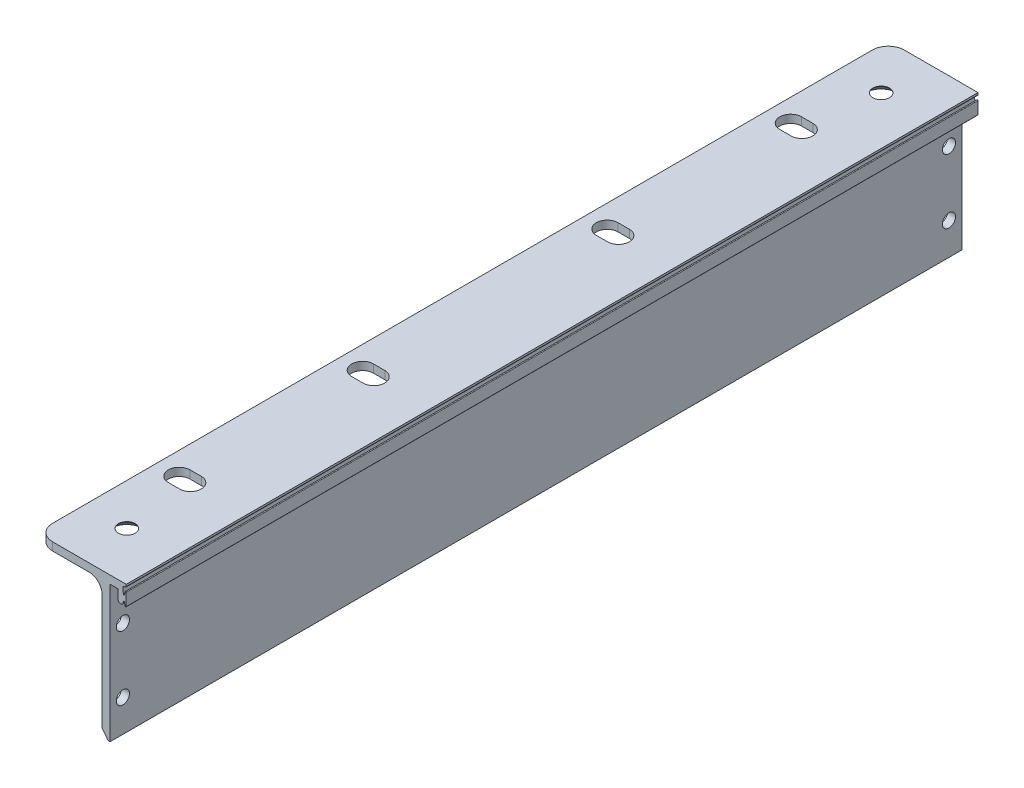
ISO-10303-21;
HEADER;
FILE_DESCRIPTION(('STEP AP214'),'2;1');
FILE_NAME('part.step','',(''),(''),'','','');
FILE_SCHEMA(('AUTOMOTIVE_DESIGN { 1 0 10303 214 1 1 1 1 }'));
ENDSEC;
DATA;
#1=APPLICATION_CONTEXT('core data for automotive mechanical design processes');
#2=APPLICATION_PROTOCOL_DEFINITION('international standard','automotive_design',2000,#1);
#3=PRODUCT_CONTEXT('',#1,'mechanical');
#4=PRODUCT('Part','Part','',(#3));
#5=PRODUCT_RELATED_PRODUCT_CATEGORY('part','',(#4));
#6=PRODUCT_DEFINITION_FORMATION('','',#4);
#7=PRODUCT_DEFINITION_CONTEXT('part definition',#1,'design');
#8=PRODUCT_DEFINITION('design','',#6,#7);
#9=PRODUCT_DEFINITION_SHAPE('','',#8);
#10=(LENGTH_UNIT() NAMED_UNIT(*) SI_UNIT(.MILLI.,.METRE.));
#11=(NAMED_UNIT(*) PLANE_ANGLE_UNIT() SI_UNIT($,.RADIAN.));
#12=(NAMED_UNIT(*) SI_UNIT($,.STERADIAN.) SOLID_ANGLE_UNIT());
#13=UNCERTAINTY_MEASURE_WITH_UNIT(LENGTH_MEASURE(1.E-05),#10,'distance_accuracy_value','');
#14=(GEOMETRIC_REPRESENTATION_CONTEXT(3) GLOBAL_UNCERTAINTY_ASSIGNED_CONTEXT((#13)) GLOBAL_UNIT_ASSIGNED_CONTEXT((#10,
#11,#12)) REPRESENTATION_CONTEXT('',''));
#15=CARTESIAN_POINT('',(0.,0.,0.));
#16=DIRECTION('',(0.,0.,1.));
#17=DIRECTION('',(1.,0.,0.));
#18=AXIS2_PLACEMENT_3D('',#15,#16,#17);
#19=CARTESIAN_POINT('',(2128.435090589,-3070.271459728,132.675));
#20=DIRECTION('',(0.,0.,-1.));
#21=DIRECTION('',(-1.,0.,0.));
#22=AXIS2_PLACEMENT_3D('',#19,#20,#21);
#23=CYLINDRICAL_SURFACE('',#22,4.);
#24=DIRECTION('',(0.,0.,-1.));
#25=VECTOR('',#24,1.);
#26=CARTESIAN_POINT('',(2128.435090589,-3066.271459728,132.675));
#27=LINE('',#26,#25);
#28=CARTESIAN_POINT('',(2128.435090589,-3066.271459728,113.890512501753));
#29=VERTEX_POINT('',#28);
#30=CARTESIAN_POINT('',(2128.435090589,-3066.271459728,-113.890512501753));
#31=VERTEX_POINT('',#30);
#32=EDGE_CURVE('E581',#29,#31,#27,.T.);
#33=ORIENTED_EDGE('',*,*,#32,.T.);
#34=CARTESIAN_POINT('',(2128.435090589,-3066.271459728,-121.109487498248));
#35=CARTESIAN_POINT('',(2128.51174059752,-3066.27146224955,-120.991919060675));
#36=CARTESIAN_POINT('',(2128.58393043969,-3066.27365162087,-120.869246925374));
#37=CARTESIAN_POINT('',(2128.71976708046,-3066.28102249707,-120.614015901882));
#38=CARTESIAN_POINT('',(2128.78341491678,-3066.28620731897,-120.481458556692));
#39=CARTESIAN_POINT('',(2128.90227111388,-3066.29838619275,-120.206470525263));
#40=CARTESIAN_POINT('',(2128.95746999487,-3066.30538360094,-120.064045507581));
#41=CARTESIAN_POINT('',(2129.03383528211,-3066.31644147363,-119.84275619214));
#42=CARTESIAN_POINT('',(2129.05826263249,-3066.32023110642,-119.767515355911));
#43=CARTESIAN_POINT('',(2129.10451509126,-3066.32780429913,-119.615757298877));
#44=CARTESIAN_POINT('',(2129.12636676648,-3066.3315894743,-119.539202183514));
#45=CARTESIAN_POINT('',(2129.18804554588,-3066.3427452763,-119.307849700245));
#46=CARTESIAN_POINT('',(2129.22418899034,-3066.34993762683,-119.150867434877));
#47=CARTESIAN_POINT('',(2129.28648090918,-3066.36298842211,-118.83193953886));
#48=CARTESIAN_POINT('',(2129.31266704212,-3066.36885426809,-118.669788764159));
#49=CARTESIAN_POINT('',(2129.34434421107,-3066.3761580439,-118.422933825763));
#50=CARTESIAN_POINT('',(2129.35363835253,-3066.37834557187,-118.339912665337));
#51=CARTESIAN_POINT('',(2129.36965280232,-3066.38215887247,-118.172453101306));
#52=CARTESIAN_POINT('',(2129.37634064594,-3066.38377678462,-118.088238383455));
#53=CARTESIAN_POINT('',(2129.39228253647,-3066.38765973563,-117.836444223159));
#54=CARTESIAN_POINT('',(2129.3975599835,-3066.38897954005,-117.668807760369));
#55=CARTESIAN_POINT('',(2129.3976209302,-3066.38899458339,-117.33410048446));
#56=CARTESIAN_POINT('',(2129.39241287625,-3066.38769209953,-117.167005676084));
#57=CARTESIAN_POINT('',(2129.37146241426,-3066.38258799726,-116.833354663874));
#58=CARTESIAN_POINT('',(2129.35570654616,-3066.37878251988,-116.666680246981));
#59=CARTESIAN_POINT('',(2129.31332667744,-3066.3690018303,-116.334320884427));
#60=CARTESIAN_POINT('',(2129.28708292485,-3066.36311956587,-116.171503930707));
#61=CARTESIAN_POINT('',(2129.22477196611,-3066.35005484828,-115.851762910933));
#62=CARTESIAN_POINT('',(2129.18871524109,-3066.34287435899,-115.694929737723));
#63=CARTESIAN_POINT('',(2129.10682381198,-3066.32804694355,-115.387231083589));
#64=CARTESIAN_POINT('',(2129.06101879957,-3066.32040287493,-115.236462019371));
#65=CARTESIAN_POINT('',(2128.9846654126,-3066.30930960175,-115.014548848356));
#66=CARTESIAN_POINT('',(2128.95792616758,-3066.30567777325,-114.941307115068));
#67=CARTESIAN_POINT('',(2128.90245461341,-3066.29875916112,-114.797841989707));
#68=CARTESIAN_POINT('',(2128.8736404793,-3066.29545780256,-114.727337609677));
#69=CARTESIAN_POINT('',(2128.72436579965,-3066.28013604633,-114.3817362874));
#70=CARTESIAN_POINT('',(2128.58832074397,-3066.27148906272,-114.1256386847));
#71=CARTESIAN_POINT('',(2128.435090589,-3066.271459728,-113.890512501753));
#72=B_SPLINE_CURVE_WITH_KNOTS('',3,(#34,#35,#36,#37,#38,#39,#40,#41,#42,#43,#44,#45,#46,#47,#48,
#49,#50,#51,#52,#53,#54,#55,#56,#57,#58,#59,#60,#61,#62,#63,#64,#65,#66,#67,#68,#69,#70,#71),
.UNSPECIFIED.,.F.,.F.,(4,2,2,2,2,2,2,2,2,2,2,2,2,2,2,2,2,2,4),(0.,0.00050203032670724,
0.00100406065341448,0.00150609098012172,0.00175710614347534,0.00200812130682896,
0.0025101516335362,0.00301218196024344,0.00326319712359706,0.00351421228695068,
0.00401624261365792,0.00451827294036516,0.0050203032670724,0.00552233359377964,
0.00602436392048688,0.00652639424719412,0.00677740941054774,0.00702842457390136,
0.00803248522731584),.UNSPECIFIED.);
#73=CARTESIAN_POINT('',(2128.435090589,-3066.271459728,-121.109487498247));
#74=VERTEX_POINT('',#73);
#75=EDGE_CURVE('E593',#31,#74,#72,.F.);
#76=ORIENTED_EDGE('',*,*,#75,.T.);
#77=CARTESIAN_POINT('',(2128.435090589,-3066.271459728,-132.675));
#78=VERTEX_POINT('',#77);
#79=EDGE_CURVE('E506',#74,#78,#27,.T.);
#80=ORIENTED_EDGE('',*,*,#79,.T.);
#81=CARTESIAN_POINT('',(2128.435090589,-3070.271459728,-132.675));
#82=DIRECTION('',(0.,0.,1.));
#83=DIRECTION('',(1.,0.,0.));
#84=AXIS2_PLACEMENT_3D('',#81,#82,#83);
#85=CIRCLE('',#84,4.);
#86=CARTESIAN_POINT('',(2132.435090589,-3070.271459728,-132.675));
#87=VERTEX_POINT('',#86);
#88=EDGE_CURVE('E507',#87,#78,#85,.T.);
#89=ORIENTED_EDGE('',*,*,#88,.F.);
#90=DIRECTION('',(0.,0.,-1.));
#91=VECTOR('',#90,1.);
#92=CARTESIAN_POINT('',(2132.435090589,-3070.271459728,132.675));
#93=LINE('',#92,#91);
#94=CARTESIAN_POINT('',(2132.435090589,-3070.271459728,132.675));
#95=VERTEX_POINT('',#94);
#96=EDGE_CURVE('E612',#95,#87,#93,.T.);
#97=ORIENTED_EDGE('',*,*,#96,.F.);
#98=CARTESIAN_POINT('',(2128.435090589,-3070.271459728,132.675));
#99=DIRECTION('',(0.,0.,1.));
#100=DIRECTION('',(1.,0.,0.));
#101=AXIS2_PLACEMENT_3D('',#98,#99,#100);
#102=CIRCLE('',#101,4.);
#103=CARTESIAN_POINT('',(2128.435090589,-3066.271459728,132.675));
#104=VERTEX_POINT('',#103);
#105=EDGE_CURVE('E449',#95,#104,#102,.T.);
#106=ORIENTED_EDGE('',*,*,#105,.T.);
#107=CARTESIAN_POINT('',(2128.435090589,-3066.271459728,121.109487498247));
#108=VERTEX_POINT('',#107);
#109=EDGE_CURVE('E578',#104,#108,#27,.T.);
#110=ORIENTED_EDGE('',*,*,#109,.T.);
#111=CARTESIAN_POINT('',(2128.435090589,-3066.271459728,113.890512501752));
#112=CARTESIAN_POINT('',(2128.51174059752,-3066.27146224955,114.008080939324));
#113=CARTESIAN_POINT('',(2128.58393043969,-3066.27365162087,114.130753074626));
#114=CARTESIAN_POINT('',(2128.71976708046,-3066.28102249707,114.385984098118));
#115=CARTESIAN_POINT('',(2128.78341491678,-3066.28620731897,114.518541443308));
#116=CARTESIAN_POINT('',(2128.90227111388,-3066.29838619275,114.793529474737));
#117=CARTESIAN_POINT('',(2128.95746999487,-3066.30538360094,114.935954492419));
#118=CARTESIAN_POINT('',(2129.03383528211,-3066.31644147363,115.15724380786));
#119=CARTESIAN_POINT('',(2129.05826263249,-3066.32023110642,115.232484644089));
#120=CARTESIAN_POINT('',(2129.10451509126,-3066.32780429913,115.384242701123));
#121=CARTESIAN_POINT('',(2129.12636676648,-3066.3315894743,115.460797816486));
#122=CARTESIAN_POINT('',(2129.18804554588,-3066.3427452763,115.692150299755));
#123=CARTESIAN_POINT('',(2129.22418899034,-3066.34993762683,115.849132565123));
#124=CARTESIAN_POINT('',(2129.28648090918,-3066.36298842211,116.168060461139));
#125=CARTESIAN_POINT('',(2129.31266704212,-3066.36885426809,116.330211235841));
#126=CARTESIAN_POINT('',(2129.34434421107,-3066.3761580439,116.577066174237));
#127=CARTESIAN_POINT('',(2129.35363835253,-3066.37834557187,116.660087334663));
#128=CARTESIAN_POINT('',(2129.36965280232,-3066.38215887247,116.827546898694));
#129=CARTESIAN_POINT('',(2129.37634064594,-3066.38377678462,116.911761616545));
#130=CARTESIAN_POINT('',(2129.39228253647,-3066.38765973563,117.163555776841));
#131=CARTESIAN_POINT('',(2129.3975599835,-3066.38897954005,117.331192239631));
#132=CARTESIAN_POINT('',(2129.3976209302,-3066.38899458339,117.66589951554));
#133=CARTESIAN_POINT('',(2129.39241287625,-3066.38769209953,117.832994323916));
#134=CARTESIAN_POINT('',(2129.37146241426,-3066.38258799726,118.166645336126));
#135=CARTESIAN_POINT('',(2129.35570654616,-3066.37878251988,118.333319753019));
#136=CARTESIAN_POINT('',(2129.31332667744,-3066.3690018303,118.665679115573));
#137=CARTESIAN_POINT('',(2129.28708292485,-3066.36311956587,118.828496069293));
#138=CARTESIAN_POINT('',(2129.22477196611,-3066.35005484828,119.148237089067));
#139=CARTESIAN_POINT('',(2129.18871524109,-3066.34287435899,119.305070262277));
#140=CARTESIAN_POINT('',(2129.10682381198,-3066.32804694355,119.612768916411));
#141=CARTESIAN_POINT('',(2129.06101879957,-3066.32040287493,119.763537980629));
#142=CARTESIAN_POINT('',(2128.9846654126,-3066.30930960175,119.985451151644));
#143=CARTESIAN_POINT('',(2128.95792616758,-3066.30567777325,120.058692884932));
#144=CARTESIAN_POINT('',(2128.90245461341,-3066.29875916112,120.202158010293));
#145=CARTESIAN_POINT('',(2128.8736404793,-3066.29545780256,120.272662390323));
#146=CARTESIAN_POINT('',(2128.72436579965,-3066.28013604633,120.6182637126));
#147=CARTESIAN_POINT('',(2128.58832074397,-3066.27148906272,120.8743613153));
#148=CARTESIAN_POINT('',(2128.435090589,-3066.271459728,121.109487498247));
#149=B_SPLINE_CURVE_WITH_KNOTS('',3,(#111,#112,#113,#114,#115,#116,#117,#118,#119,#120,#121,
#122,#123,#124,#125,#126,#127,#128,#129,#130,#131,#132,#133,#134,#135,#136,#137,#138,#139,#140,
#141,#142,#143,#144,#145,#146,#147,#148),.UNSPECIFIED.,.F.,.F.,(4,2,2,2,2,2,2,2,2,2,2,2,2,2,2,2,
2,2,4),(0.,0.00050203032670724,0.00100406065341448,0.00150609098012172,0.00175710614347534,
0.00200812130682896,0.0025101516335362,0.00301218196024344,0.00326319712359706,
0.00351421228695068,0.00401624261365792,0.00451827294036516,0.0050203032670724,
0.00552233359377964,0.00602436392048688,0.00652639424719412,0.00677740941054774,
0.00702842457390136,0.00803248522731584),.UNSPECIFIED.);
#150=EDGE_CURVE('E694',#108,#29,#149,.F.);
#151=ORIENTED_EDGE('',*,*,#150,.T.);
#152=EDGE_LOOP('',(#33,#76,#80,#89,#97,#106,#110,#151));
#153=FACE_BOUND('',#152,.T.);
#154=ADVANCED_FACE('F41',(#153),#23,.F.);
#155=CARTESIAN_POINT('',(2132.43509058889,7.89159512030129E-11,132.675));
#156=DIRECTION('',(1.,0.,0.));
#157=DIRECTION('',(0.,1.,0.));
#158=AXIS2_PLACEMENT_3D('',#155,#156,#157);
#159=PLANE('',#158);
#160=CARTESIAN_POINT('',(2132.435090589,-3078.771459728,128.675));
#161=DIRECTION('',(-1.,0.,0.));
#162=DIRECTION('',(0.,1.,0.));
#163=AXIS2_PLACEMENT_3D('',#160,#161,#162);
#164=CIRCLE('',#163,2.04999999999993);
#165=CARTESIAN_POINT('',(2132.435090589,-3076.721459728,128.675));
#166=VERTEX_POINT('',#165);
#167=EDGE_CURVE('E427',#166,#166,#164,.T.);
#168=ORIENTED_EDGE('',*,*,#167,.F.);
#169=EDGE_LOOP('',(#168));
#170=FACE_BOUND('',#169,.T.);
#171=CARTESIAN_POINT('',(2132.435090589,-3098.771459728,128.675));
#172=DIRECTION('',(-1.,0.,0.));
#173=DIRECTION('',(0.,1.,0.));
#174=AXIS2_PLACEMENT_3D('',#171,#172,#173);
#175=CIRCLE('',#174,2.0499999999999);
#176=CARTESIAN_POINT('',(2132.435090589,-3096.721459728,128.675));
#177=VERTEX_POINT('',#176);
#178=EDGE_CURVE('E437',#177,#177,#175,.T.);
#179=ORIENTED_EDGE('',*,*,#178,.F.);
#180=EDGE_LOOP('',(#179));
#181=FACE_BOUND('',#180,.T.);
#182=CARTESIAN_POINT('',(2132.435090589,-3098.771459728,-128.675));
#183=DIRECTION('',(-1.,0.,0.));
#184=DIRECTION('',(0.,-1.,0.));
#185=AXIS2_PLACEMENT_3D('',#182,#183,#184);
#186=CIRCLE('',#185,2.0499999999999);
#187=CARTESIAN_POINT('',(2132.435090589,-3100.821459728,-128.675));
#188=VERTEX_POINT('',#187);
#189=EDGE_CURVE('E441',#188,#188,#186,.T.);
#190=ORIENTED_EDGE('',*,*,#189,.F.);
#191=EDGE_LOOP('',(#190));
#192=FACE_BOUND('',#191,.T.);
#193=CARTESIAN_POINT('',(2132.435090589,-3078.771459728,-128.675));
#194=DIRECTION('',(-1.,0.,0.));
#195=DIRECTION('',(0.,-1.,0.));
#196=AXIS2_PLACEMENT_3D('',#193,#194,#195);
#197=CIRCLE('',#196,2.0499999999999);
#198=CARTESIAN_POINT('',(2132.435090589,-3080.821459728,-128.675));
#199=VERTEX_POINT('',#198);
#200=EDGE_CURVE('E445',#199,#199,#197,.T.);
#201=ORIENTED_EDGE('',*,*,#200,.F.);
#202=EDGE_LOOP('',(#201));
#203=FACE_BOUND('',#202,.T.);
#204=DIRECTION('',(0.,-1.,0.));
#205=VECTOR('',#204,1.);
#206=CARTESIAN_POINT('',(2132.43509058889,7.89159512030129E-11,-132.675));
#207=LINE('',#206,#205);
#208=CARTESIAN_POINT('',(2132.435090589,-3106.271459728,-132.675));
#209=VERTEX_POINT('',#208);
#210=EDGE_CURVE('E510',#87,#209,#207,.T.);
#211=ORIENTED_EDGE('',*,*,#210,.T.);
#212=DIRECTION('',(0.,0.,-1.));
#213=VECTOR('',#212,1.);
#214=CARTESIAN_POINT('',(2132.435090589,-3106.271459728,132.675));
#215=LINE('',#214,#213);
#216=CARTESIAN_POINT('',(2132.435090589,-3106.271459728,132.675));
#217=VERTEX_POINT('',#216);
#218=EDGE_CURVE('E610',#217,#209,#215,.T.);
#219=ORIENTED_EDGE('',*,*,#218,.F.);
#220=DIRECTION('',(0.,-1.,0.));
#221=VECTOR('',#220,1.);
#222=CARTESIAN_POINT('',(2132.43509058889,7.89159512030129E-11,132.675));
#223=LINE('',#222,#221);
#224=EDGE_CURVE('E452',#95,#217,#223,.T.);
#225=ORIENTED_EDGE('',*,*,#224,.F.);
#226=ORIENTED_EDGE('',*,*,#96,.T.);
#227=EDGE_LOOP('',(#211,#219,#225,#226));
#228=FACE_BOUND('',#227,.T.);
#229=ADVANCED_FACE('F608',(#170,#181,#192,#203,#228),#159,.F.);
#230=CARTESIAN_POINT('',(-144.733277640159,-109.997291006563,132.675));
#231=DIRECTION('',(0.796162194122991,0.605083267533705,0.));
#232=DIRECTION('',(-0.605083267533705,0.796162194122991,0.));
#233=AXIS2_PLACEMENT_3D('',#230,#231,#232);
#234=PLANE('',#233);
#235=DIRECTION('',(0.605083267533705,-0.796162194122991,0.));
#236=VECTOR('',#235,1.);
#237=CARTESIAN_POINT('',(-144.733277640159,-109.997291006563,-132.675));
#238=LINE('',#237,#236);
#239=CARTESIAN_POINT('',(2134.335090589,-3108.771459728,-132.675));
#240=VERTEX_POINT('',#239);
#241=EDGE_CURVE('E512',#209,#240,#238,.T.);
#242=ORIENTED_EDGE('',*,*,#241,.T.);
#243=DIRECTION('',(0.,0.,-1.));
#244=VECTOR('',#243,1.);
#245=CARTESIAN_POINT('',(2134.335090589,-3108.771459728,132.675));
#246=LINE('',#245,#244);
#247=CARTESIAN_POINT('',(2134.335090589,-3108.771459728,132.675));
#248=VERTEX_POINT('',#247);
#249=EDGE_CURVE('E616',#248,#240,#246,.T.);
#250=ORIENTED_EDGE('',*,*,#249,.F.);
#251=DIRECTION('',(0.605083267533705,-0.796162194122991,0.));
#252=VECTOR('',#251,1.);
#253=CARTESIAN_POINT('',(-144.733277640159,-109.997291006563,132.675));
#254=LINE('',#253,#252);
#255=EDGE_CURVE('E455',#217,#248,#254,.T.);
#256=ORIENTED_EDGE('',*,*,#255,.F.);
#257=ORIENTED_EDGE('',*,*,#218,.T.);
#258=EDGE_LOOP('',(#242,#250,#256,#257));
#259=FACE_BOUND('',#258,.T.);
#260=ADVANCED_FACE('F614',(#259),#234,.F.);
#261=CARTESIAN_POINT('',(0.,-3108.771459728,132.675));
#262=DIRECTION('',(0.,-1.,0.));
#263=DIRECTION('',(0.,0.,-1.));
#264=AXIS2_PLACEMENT_3D('',#261,#262,#263);
#265=PLANE('',#264);
#266=DIRECTION('',(-1.,0.,0.));
#267=VECTOR('',#266,1.);
#268=CARTESIAN_POINT('',(0.,-3108.771459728,-132.675));
#269=LINE('',#268,#267);
#270=CARTESIAN_POINT('',(2134.93509058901,-3108.771459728,-132.675));
#271=VERTEX_POINT('',#270);
#272=EDGE_CURVE('E515',#271,#240,#269,.T.);
#273=ORIENTED_EDGE('',*,*,#272,.F.);
#274=DIRECTION('',(0.,0.,-1.));
#275=VECTOR('',#274,1.);
#276=CARTESIAN_POINT('',(2134.93509058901,-3108.771459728,132.675));
#277=LINE('',#276,#275);
#278=CARTESIAN_POINT('',(2134.93509058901,-3108.771459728,132.675));
#279=VERTEX_POINT('',#278);
#280=EDGE_CURVE('E620',#279,#271,#277,.T.);
#281=ORIENTED_EDGE('',*,*,#280,.F.);
#282=DIRECTION('',(-1.,0.,0.));
#283=VECTOR('',#282,1.);
#284=CARTESIAN_POINT('',(0.,-3108.771459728,132.675));
#285=LINE('',#284,#283);
#286=EDGE_CURVE('E457',#279,#248,#285,.T.);
#287=ORIENTED_EDGE('',*,*,#286,.T.);
#288=ORIENTED_EDGE('',*,*,#249,.T.);
#289=EDGE_LOOP('',(#273,#281,#287,#288));
#290=FACE_BOUND('',#289,.T.);
#291=ADVANCED_FACE('F995',(#290),#265,.T.);
#292=CARTESIAN_POINT('',(2134.93509058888,8.92330952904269E-11,132.675));
#293=DIRECTION('',(1.,0.,0.));
#294=DIRECTION('',(0.,1.,0.));
#295=AXIS2_PLACEMENT_3D('',#292,#293,#294);
#296=PLANE('',#295);
#297=CARTESIAN_POINT('',(2134.935090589,-3078.771459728,128.675));
#298=DIRECTION('',(1.,0.,0.));
#299=DIRECTION('',(0.,1.,0.));
#300=AXIS2_PLACEMENT_3D('',#297,#298,#299);
#301=CIRCLE('',#300,2.04999999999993);
#302=CARTESIAN_POINT('',(2134.935090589,-3076.721459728,128.675));
#303=VERTEX_POINT('',#302);
#304=EDGE_CURVE('E436',#303,#303,#301,.T.);
#305=ORIENTED_EDGE('',*,*,#304,.F.);
#306=EDGE_LOOP('',(#305));
#307=FACE_BOUND('',#306,.T.);
#308=CARTESIAN_POINT('',(2134.935090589,-3098.771459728,128.675));
#309=DIRECTION('',(1.,0.,0.));
#310=DIRECTION('',(0.,1.,0.));
#311=AXIS2_PLACEMENT_3D('',#308,#309,#310);
#312=CIRCLE('',#311,2.0499999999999);
#313=CARTESIAN_POINT('',(2134.935090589,-3096.721459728,128.675));
#314=VERTEX_POINT('',#313);
#315=EDGE_CURVE('E440',#314,#314,#312,.T.);
#316=ORIENTED_EDGE('',*,*,#315,.F.);
#317=EDGE_LOOP('',(#316));
#318=FACE_BOUND('',#317,.T.);
#319=CARTESIAN_POINT('',(2134.935090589,-3098.771459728,-128.675));
#320=DIRECTION('',(1.,0.,0.));
#321=DIRECTION('',(0.,1.,0.));
#322=AXIS2_PLACEMENT_3D('',#319,#320,#321);
#323=CIRCLE('',#322,2.0499999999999);
#324=CARTESIAN_POINT('',(2134.935090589,-3096.721459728,-128.675));
#325=VERTEX_POINT('',#324);
#326=EDGE_CURVE('E444',#325,#325,#323,.T.);
#327=ORIENTED_EDGE('',*,*,#326,.F.);
#328=EDGE_LOOP('',(#327));
#329=FACE_BOUND('',#328,.T.);
#330=CARTESIAN_POINT('',(2134.935090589,-3078.771459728,-128.675));
#331=DIRECTION('',(1.,0.,0.));
#332=DIRECTION('',(0.,1.,0.));
#333=AXIS2_PLACEMENT_3D('',#330,#331,#332);
#334=CIRCLE('',#333,2.0499999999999);
#335=CARTESIAN_POINT('',(2134.935090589,-3076.721459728,-128.675));
#336=VERTEX_POINT('',#335);
#337=EDGE_CURVE('E448',#336,#336,#334,.T.);
#338=ORIENTED_EDGE('',*,*,#337,.F.);
#339=EDGE_LOOP('',(#338));
#340=FACE_BOUND('',#339,.T.);
#341=DIRECTION('',(0.,-1.,0.));
#342=VECTOR('',#341,1.);
#343=CARTESIAN_POINT('',(2134.93509058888,8.92330952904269E-11,-132.675));
#344=LINE('',#343,#342);
#345=CARTESIAN_POINT('',(2134.935090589,-3066.271459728,-132.675));
#346=VERTEX_POINT('',#345);
#347=EDGE_CURVE('E518',#346,#271,#344,.T.);
#348=ORIENTED_EDGE('',*,*,#347,.F.);
#349=DIRECTION('',(0.,0.,-1.));
#350=VECTOR('',#349,1.);
#351=CARTESIAN_POINT('',(2134.935090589,-3066.271459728,132.675));
#352=LINE('',#351,#350);
#353=CARTESIAN_POINT('',(2134.935090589,-3066.271459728,132.675));
#354=VERTEX_POINT('',#353);
#355=EDGE_CURVE('E987',#354,#346,#352,.T.);
#356=ORIENTED_EDGE('',*,*,#355,.F.);
#357=DIRECTION('',(0.,-1.,0.));
#358=VECTOR('',#357,1.);
#359=CARTESIAN_POINT('',(2134.93509058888,8.92330952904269E-11,132.675));
#360=LINE('',#359,#358);
#361=EDGE_CURVE('E460',#354,#279,#360,.T.);
#362=ORIENTED_EDGE('',*,*,#361,.T.);
#363=ORIENTED_EDGE('',*,*,#280,.T.);
#364=EDGE_LOOP('',(#348,#356,#362,#363));
#365=FACE_BOUND('',#364,.T.);
#366=ADVANCED_FACE('F991',(#307,#318,#329,#340,#365),#296,.T.);
#367=CARTESIAN_POINT('',(-1.08935845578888E-09,-3066.27145972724,132.675));
#368=DIRECTION('',(3.55271367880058E-13,1.,0.));
#369=DIRECTION('',(-1.,3.55271367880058E-13,0.));
#370=AXIS2_PLACEMENT_3D('',#367,#368,#369);
#371=PLANE('',#370);
#372=DIRECTION('',(1.,-3.55271367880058E-13,0.));
#373=VECTOR('',#372,1.);
#374=CARTESIAN_POINT('',(-1.08935845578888E-09,-3066.27145972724,-132.675));
#375=LINE('',#374,#373);
#376=CARTESIAN_POINT('',(2137.435090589,-3066.271459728,-132.675));
#377=VERTEX_POINT('',#376);
#378=EDGE_CURVE('E521',#346,#377,#375,.T.);
#379=ORIENTED_EDGE('',*,*,#378,.T.);
#380=DIRECTION('',(0.,0.,-1.));
#381=VECTOR('',#380,1.);
#382=CARTESIAN_POINT('',(2137.435090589,-3066.271459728,132.675));
#383=LINE('',#382,#381);
#384=CARTESIAN_POINT('',(2137.435090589,-3066.271459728,132.675));
#385=VERTEX_POINT('',#384);
#386=EDGE_CURVE('E984',#385,#377,#383,.T.);
#387=ORIENTED_EDGE('',*,*,#386,.F.);
#388=DIRECTION('',(1.,-3.55271367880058E-13,0.));
#389=VECTOR('',#388,1.);
#390=CARTESIAN_POINT('',(-1.08935845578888E-09,-3066.27145972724,132.675));
#391=LINE('',#390,#389);
#392=EDGE_CURVE('E463',#354,#385,#391,.T.);
#393=ORIENTED_EDGE('',*,*,#392,.F.);
#394=ORIENTED_EDGE('',*,*,#355,.T.);
#395=EDGE_LOOP('',(#379,#387,#393,#394));
#396=FACE_BOUND('',#395,.T.);
#397=ADVANCED_FACE('F1001',(#396),#371,.F.);
#398=CARTESIAN_POINT('',(2137.43509058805,6.62327875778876E-10,132.675));
#399=DIRECTION('',(1.,3.09870404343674E-13,0.));
#400=DIRECTION('',(-3.09870404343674E-13,1.,0.));
#401=AXIS2_PLACEMENT_3D('',#398,#399,#400);
#402=PLANE('',#401);
#403=DIRECTION('',(3.09870404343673E-13,-1.,0.));
#404=VECTOR('',#403,1.);
#405=CARTESIAN_POINT('',(2137.43509058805,6.62327875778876E-10,-132.675));
#406=LINE('',#405,#404);
#407=CARTESIAN_POINT('',(2137.435090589,-3069.1377496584,-132.675));
#408=VERTEX_POINT('',#407);
#409=EDGE_CURVE('E523',#377,#408,#406,.T.);
#410=ORIENTED_EDGE('',*,*,#409,.T.);
#411=DIRECTION('',(0.,0.,-1.));
#412=VECTOR('',#411,1.);
#413=CARTESIAN_POINT('',(2137.435090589,-3069.1377496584,132.675));
#414=LINE('',#413,#412);
#415=CARTESIAN_POINT('',(2137.435090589,-3069.1377496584,132.675));
#416=VERTEX_POINT('',#415);
#417=EDGE_CURVE('E981',#416,#408,#414,.T.);
#418=ORIENTED_EDGE('',*,*,#417,.F.);
#419=DIRECTION('',(3.09870404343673E-13,-1.,0.));
#420=VECTOR('',#419,1.);
#421=CARTESIAN_POINT('',(2137.43509058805,6.62327875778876E-10,132.675));
#422=LINE('',#421,#420);
#423=EDGE_CURVE('E465',#385,#416,#422,.T.);
#424=ORIENTED_EDGE('',*,*,#423,.F.);
#425=ORIENTED_EDGE('',*,*,#386,.T.);
#426=EDGE_LOOP('',(#410,#418,#424,#425));
#427=FACE_BOUND('',#426,.T.);
#428=ADVANCED_FACE('F1005',(#427),#402,.F.);
#429=CARTESIAN_POINT('',(2138.2188006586,-3069.1377496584,132.675));
#430=DIRECTION('',(0.,0.,-1.));
#431=DIRECTION('',(-1.,0.,0.));
#432=AXIS2_PLACEMENT_3D('',#429,#430,#431);
#433=CYLINDRICAL_SURFACE('',#432,0.783710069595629);
#434=CARTESIAN_POINT('',(2138.2188006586,-3069.1377496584,-132.675));
#435=DIRECTION('',(0.,0.,1.));
#436=DIRECTION('',(1.,0.,0.));
#437=AXIS2_PLACEMENT_3D('',#434,#435,#436);
#438=CIRCLE('',#437,0.783710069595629);
#439=CARTESIAN_POINT('',(2138.97524023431,-3069.34269023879,-132.675));
#440=VERTEX_POINT('',#439);
#441=EDGE_CURVE('E525',#408,#440,#438,.T.);
#442=ORIENTED_EDGE('',*,*,#441,.T.);
#443=DIRECTION('',(0.,0.,-1.));
#444=VECTOR('',#443,1.);
#445=CARTESIAN_POINT('',(2138.97524023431,-3069.34269023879,132.675));
#446=LINE('',#445,#444);
#447=CARTESIAN_POINT('',(2138.97524023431,-3069.34269023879,132.675));
#448=VERTEX_POINT('',#447);
#449=EDGE_CURVE('E978',#448,#440,#446,.T.);
#450=ORIENTED_EDGE('',*,*,#449,.F.);
#451=CARTESIAN_POINT('',(2138.2188006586,-3069.1377496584,132.675));
#452=DIRECTION('',(0.,0.,1.));
#453=DIRECTION('',(1.,0.,0.));
#454=AXIS2_PLACEMENT_3D('',#451,#452,#453);
#455=CIRCLE('',#454,0.783710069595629);
#456=EDGE_CURVE('E467',#416,#448,#455,.T.);
#457=ORIENTED_EDGE('',*,*,#456,.F.);
#458=ORIENTED_EDGE('',*,*,#417,.T.);
#459=EDGE_LOOP('',(#442,#450,#457,#458));
#460=FACE_BOUND('',#459,.T.);
#461=ADVANCED_FACE('F1014',(#460),#433,.T.);
#462=CARTESIAN_POINT('',(2767.41239594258,-749.769209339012,132.675));
#463=DIRECTION('',(-0.965203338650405,0.261500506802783,0.));
#464=DIRECTION('',(-0.261500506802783,-0.965203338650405,0.));
#465=AXIS2_PLACEMENT_3D('',#462,#463,#464);
#466=PLANE('',#465);
#467=DIRECTION('',(0.261500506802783,0.965203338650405,0.));
#468=VECTOR('',#467,1.);
#469=CARTESIAN_POINT('',(2767.41239594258,-749.769209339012,-132.675));
#470=LINE('',#469,#468);
#471=CARTESIAN_POINT('',(2139.12031008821,-3068.80723465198,-132.675));
#472=VERTEX_POINT('',#471);
#473=EDGE_CURVE('E527',#440,#472,#470,.T.);
#474=ORIENTED_EDGE('',*,*,#473,.T.);
#475=DIRECTION('',(0.,0.,-1.));
#476=VECTOR('',#475,1.);
#477=CARTESIAN_POINT('',(2139.12031008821,-3068.80723465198,132.675));
#478=LINE('',#477,#476);
#479=CARTESIAN_POINT('',(2139.12031008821,-3068.80723465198,132.675));
#480=VERTEX_POINT('',#479);
#481=EDGE_CURVE('E976',#480,#472,#478,.T.);
#482=ORIENTED_EDGE('',*,*,#481,.F.);
#483=DIRECTION('',(0.261500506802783,0.965203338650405,0.));
#484=VECTOR('',#483,1.);
#485=CARTESIAN_POINT('',(2767.41239594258,-749.769209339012,132.675));
#486=LINE('',#485,#484);
#487=EDGE_CURVE('E469',#448,#480,#486,.T.);
#488=ORIENTED_EDGE('',*,*,#487,.F.);
#489=ORIENTED_EDGE('',*,*,#449,.T.);
#490=EDGE_LOOP('',(#474,#482,#488,#489));
#491=FACE_BOUND('',#490,.T.);
#492=ADVANCED_FACE('F1017',(#491),#466,.F.);
#493=CARTESIAN_POINT('',(2139.265090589,-3068.846459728,132.675));
#494=DIRECTION('',(0.,0.,-1.));
#495=DIRECTION('',(-1.,0.,0.));
#496=AXIS2_PLACEMENT_3D('',#493,#494,#495);
#497=CYLINDRICAL_SURFACE('',#496,0.149999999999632);
#498=CARTESIAN_POINT('',(2139.265090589,-3068.846459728,-132.675));
#499=DIRECTION('',(0.,0.,1.));
#500=DIRECTION('',(1.,0.,0.));
#501=AXIS2_PLACEMENT_3D('',#498,#499,#500);
#502=CIRCLE('',#501,0.149999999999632);
#503=CARTESIAN_POINT('',(2139.41070658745,-3068.81045999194,-132.675));
#504=VERTEX_POINT('',#503);
#505=EDGE_CURVE('E530',#504,#472,#502,.T.);
#506=ORIENTED_EDGE('',*,*,#505,.F.);
#507=DIRECTION('',(0.,0.,-1.));
#508=VECTOR('',#507,1.);
#509=CARTESIAN_POINT('',(2139.41070658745,-3068.81045999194,132.675));
#510=LINE('',#509,#508);
#511=CARTESIAN_POINT('',(2139.41070658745,-3068.81045999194,132.675));
#512=VERTEX_POINT('',#511);
#513=EDGE_CURVE('E974',#512,#504,#510,.T.);
#514=ORIENTED_EDGE('',*,*,#513,.F.);
#515=CARTESIAN_POINT('',(2139.265090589,-3068.846459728,132.675));
#516=DIRECTION('',(0.,0.,1.));
#517=DIRECTION('',(1.,0.,0.));
#518=AXIS2_PLACEMENT_3D('',#515,#516,#517);
#519=CIRCLE('',#518,0.149999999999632);
#520=EDGE_CURVE('E471',#512,#480,#519,.T.);
#521=ORIENTED_EDGE('',*,*,#520,.T.);
#522=ORIENTED_EDGE('',*,*,#481,.T.);
#523=EDGE_LOOP('',(#506,#514,#521,#522));
#524=FACE_BOUND('',#523,.T.);
#525=ADVANCED_FACE('F1020',(#524),#497,.F.);
#526=CARTESIAN_POINT('',(1301.19906034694,321.687336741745,132.675));
#527=DIRECTION('',(0.970773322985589,0.239998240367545,0.));
#528=DIRECTION('',(-0.239998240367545,0.970773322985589,0.));
#529=AXIS2_PLACEMENT_3D('',#526,#527,#528);
#530=PLANE('',#529);
#531=DIRECTION('',(0.239998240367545,-0.970773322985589,0.));
#532=VECTOR('',#531,1.);
#533=CARTESIAN_POINT('',(1301.19906034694,321.687336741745,-132.675));
#534=LINE('',#533,#532);
#535=CARTESIAN_POINT('',(2139.65483992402,-3069.79795944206,-132.675));
#536=VERTEX_POINT('',#535);
#537=EDGE_CURVE('E533',#504,#536,#534,.T.);
#538=ORIENTED_EDGE('',*,*,#537,.T.);
#539=DIRECTION('',(0.,0.,-1.));
#540=VECTOR('',#539,1.);
#541=CARTESIAN_POINT('',(2139.65483992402,-3069.79795944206,132.675));
#542=LINE('',#541,#540);
#543=CARTESIAN_POINT('',(2139.65483992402,-3069.79795944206,132.675));
#544=VERTEX_POINT('',#543);
#545=EDGE_CURVE('E971',#544,#536,#542,.T.);
#546=ORIENTED_EDGE('',*,*,#545,.F.);
#547=DIRECTION('',(0.239998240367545,-0.970773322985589,0.));
#548=VECTOR('',#547,1.);
#549=CARTESIAN_POINT('',(1301.19906034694,321.687336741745,132.675));
#550=LINE('',#549,#548);
#551=EDGE_CURVE('E474',#512,#544,#550,.T.);
#552=ORIENTED_EDGE('',*,*,#551,.F.);
#553=ORIENTED_EDGE('',*,*,#513,.T.);
#554=EDGE_LOOP('',(#538,#546,#552,#553));
#555=FACE_BOUND('',#554,.T.);
#556=ADVANCED_FACE('F1027',(#555),#530,.F.);
#557=CARTESIAN_POINT('',(2139.812590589,-3069.758959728,132.675));
#558=DIRECTION('',(0.,0.,-1.));
#559=DIRECTION('',(-1.,0.,0.));
#560=AXIS2_PLACEMENT_3D('',#557,#558,#559);
#561=CYLINDRICAL_SURFACE('',#560,0.162500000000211);
#562=CARTESIAN_POINT('',(2139.812590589,-3069.758959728,-132.675));
#563=DIRECTION('',(0.,0.,1.));
#564=DIRECTION('',(1.,0.,0.));
#565=AXIS2_PLACEMENT_3D('',#562,#563,#564);
#566=CIRCLE('',#565,0.162500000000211);
#567=CARTESIAN_POINT('',(2139.97509058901,-3069.758959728,-132.675));
#568=VERTEX_POINT('',#567);
#569=EDGE_CURVE('E535',#536,#568,#566,.T.);
#570=ORIENTED_EDGE('',*,*,#569,.T.);
#571=DIRECTION('',(0.,0.,-1.));
#572=VECTOR('',#571,1.);
#573=CARTESIAN_POINT('',(2139.97509058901,-3069.758959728,132.675));
#574=LINE('',#573,#572);
#575=CARTESIAN_POINT('',(2139.97509058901,-3069.758959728,132.675));
#576=VERTEX_POINT('',#575);
#577=EDGE_CURVE('E969',#576,#568,#574,.T.);
#578=ORIENTED_EDGE('',*,*,#577,.F.);
#579=CARTESIAN_POINT('',(2139.812590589,-3069.758959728,132.675));
#580=DIRECTION('',(0.,0.,1.));
#581=DIRECTION('',(1.,0.,0.));
#582=AXIS2_PLACEMENT_3D('',#579,#580,#581);
#583=CIRCLE('',#582,0.162500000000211);
#584=EDGE_CURVE('E476',#544,#576,#583,.T.);
#585=ORIENTED_EDGE('',*,*,#584,.F.);
#586=ORIENTED_EDGE('',*,*,#545,.T.);
#587=EDGE_LOOP('',(#570,#578,#585,#586));
#588=FACE_BOUND('',#587,.T.);
#589=ADVANCED_FACE('F1031',(#588),#561,.T.);
#590=CARTESIAN_POINT('',(2139.97509058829,4.96909723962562E-10,132.675));
#591=DIRECTION('',(1.,2.32203508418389E-13,0.));
#592=DIRECTION('',(-2.32203508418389E-13,1.,0.));
#593=AXIS2_PLACEMENT_3D('',#590,#591,#592);
#594=PLANE('',#593);
#595=DIRECTION('',(2.32203508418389E-13,-1.,0.));
#596=VECTOR('',#595,1.);
#597=CARTESIAN_POINT('',(2139.97509058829,4.96909723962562E-10,-132.675));
#598=LINE('',#597,#596);
#599=CARTESIAN_POINT('',(2139.975090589,-3065.933959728,-132.675));
#600=VERTEX_POINT('',#599);
#601=EDGE_CURVE('E538',#600,#568,#598,.T.);
#602=ORIENTED_EDGE('',*,*,#601,.F.);
#603=DIRECTION('',(0.,0.,-1.));
#604=VECTOR('',#603,1.);
#605=CARTESIAN_POINT('',(2139.975090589,-3065.933959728,132.675));
#606=LINE('',#605,#604);
#607=CARTESIAN_POINT('',(2139.975090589,-3065.933959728,132.675));
#608=VERTEX_POINT('',#607);
#609=EDGE_CURVE('E967',#608,#600,#606,.T.);
#610=ORIENTED_EDGE('',*,*,#609,.F.);
#611=DIRECTION('',(2.32203508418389E-13,-1.,0.));
#612=VECTOR('',#611,1.);
#613=CARTESIAN_POINT('',(2139.97509058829,4.96909723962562E-10,132.675));
#614=LINE('',#613,#612);
#615=EDGE_CURVE('E478',#608,#576,#614,.T.);
#616=ORIENTED_EDGE('',*,*,#615,.T.);
#617=ORIENTED_EDGE('',*,*,#577,.T.);
#618=EDGE_LOOP('',(#602,#610,#616,#617));
#619=FACE_BOUND('',#618,.T.);
#620=ADVANCED_FACE('F1034',(#619),#594,.T.);
#621=CARTESIAN_POINT('',(2139.812590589,-3065.933959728,132.675));
#622=DIRECTION('',(0.,0.,-1.));
#623=DIRECTION('',(-1.,0.,0.));
#624=AXIS2_PLACEMENT_3D('',#621,#622,#623);
#625=CYLINDRICAL_SURFACE('',#624,0.162500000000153);
#626=CARTESIAN_POINT('',(2139.812590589,-3065.933959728,-132.675));
#627=DIRECTION('',(0.,0.,1.));
#628=DIRECTION('',(1.,0.,0.));
#629=AXIS2_PLACEMENT_3D('',#626,#627,#628);
#630=CIRCLE('',#629,0.162500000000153);
#631=CARTESIAN_POINT('',(2139.65483992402,-3065.89496001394,-132.675));
#632=VERTEX_POINT('',#631);
#633=EDGE_CURVE('E541',#600,#632,#630,.T.);
#634=ORIENTED_EDGE('',*,*,#633,.T.);
#635=DIRECTION('',(0.,0.,-1.));
#636=VECTOR('',#635,1.);
#637=CARTESIAN_POINT('',(2139.65483992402,-3065.89496001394,132.675));
#638=LINE('',#637,#636);
#639=CARTESIAN_POINT('',(2139.65483992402,-3065.89496001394,132.675));
#640=VERTEX_POINT('',#639);
#641=EDGE_CURVE('E965',#640,#632,#638,.T.);
#642=ORIENTED_EDGE('',*,*,#641,.F.);
#643=CARTESIAN_POINT('',(2139.812590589,-3065.933959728,132.675));
#644=DIRECTION('',(0.,0.,1.));
#645=DIRECTION('',(1.,0.,0.));
#646=AXIS2_PLACEMENT_3D('',#643,#644,#645);
#647=CIRCLE('',#646,0.162500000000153);
#648=EDGE_CURVE('E481',#608,#640,#647,.T.);
#649=ORIENTED_EDGE('',*,*,#648,.F.);
#650=ORIENTED_EDGE('',*,*,#609,.T.);
#651=EDGE_LOOP('',(#634,#642,#649,#650));
#652=FACE_BOUND('',#651,.T.);
#653=ADVANCED_FACE('F1040',(#652),#625,.T.);
#654=CARTESIAN_POINT('',(2730.71666034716,-675.098066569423,132.675));
#655=DIRECTION('',(-0.970773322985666,0.23999824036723,0.));
#656=DIRECTION('',(-0.23999824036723,-0.970773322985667,0.));
#657=AXIS2_PLACEMENT_3D('',#654,#655,#656);
#658=PLANE('',#657);
#659=DIRECTION('',(0.23999824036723,0.970773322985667,0.));
#660=VECTOR('',#659,1.);
#661=CARTESIAN_POINT('',(2730.71666034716,-675.098066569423,-132.675));
#662=LINE('',#661,#660);
#663=CARTESIAN_POINT('',(2139.41070658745,-3066.88245946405,-132.675));
#664=VERTEX_POINT('',#663);
#665=EDGE_CURVE('E544',#664,#632,#662,.T.);
#666=ORIENTED_EDGE('',*,*,#665,.F.);
#667=DIRECTION('',(0.,0.,-1.));
#668=VECTOR('',#667,1.);
#669=CARTESIAN_POINT('',(2139.41070658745,-3066.88245946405,132.675));
#670=LINE('',#669,#668);
#671=CARTESIAN_POINT('',(2139.41070658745,-3066.88245946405,132.675));
#672=VERTEX_POINT('',#671);
#673=EDGE_CURVE('E963',#672,#664,#670,.T.);
#674=ORIENTED_EDGE('',*,*,#673,.F.);
#675=DIRECTION('',(0.23999824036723,0.970773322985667,0.));
#676=VECTOR('',#675,1.);
#677=CARTESIAN_POINT('',(2730.71666034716,-675.098066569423,132.675));
#678=LINE('',#677,#676);
#679=EDGE_CURVE('E483',#672,#640,#678,.T.);
#680=ORIENTED_EDGE('',*,*,#679,.T.);
#681=ORIENTED_EDGE('',*,*,#641,.T.);
#682=EDGE_LOOP('',(#666,#674,#680,#681));
#683=FACE_BOUND('',#682,.T.);
#684=ADVANCED_FACE('F1044',(#683),#658,.T.);
#685=CARTESIAN_POINT('',(2139.265090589,-3066.846459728,132.675));
#686=DIRECTION('',(0.,0.,-1.));
#687=DIRECTION('',(-1.,0.,0.));
#688=AXIS2_PLACEMENT_3D('',#685,#686,#687);
#689=CYLINDRICAL_SURFACE('',#688,0.149999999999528);
#690=CARTESIAN_POINT('',(2139.265090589,-3066.846459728,-132.675));
#691=DIRECTION('',(0.,0.,1.));
#692=DIRECTION('',(1.,0.,0.));
#693=AXIS2_PLACEMENT_3D('',#690,#691,#692);
#694=CIRCLE('',#693,0.149999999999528);
#695=CARTESIAN_POINT('',(2139.11611424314,-3066.86395396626,-132.675));
#696=VERTEX_POINT('',#695);
#697=EDGE_CURVE('E547',#696,#664,#694,.T.);
#698=ORIENTED_EDGE('',*,*,#697,.F.);
#699=DIRECTION('',(0.,0.,-1.));
#700=VECTOR('',#699,1.);
#701=CARTESIAN_POINT('',(2139.11611424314,-3066.86395396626,132.675));
#702=LINE('',#701,#700);
#703=CARTESIAN_POINT('',(2139.11611424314,-3066.86395396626,132.675));
#704=VERTEX_POINT('',#703);
#705=EDGE_CURVE('E961',#704,#696,#702,.T.);
#706=ORIENTED_EDGE('',*,*,#705,.F.);
#707=CARTESIAN_POINT('',(2139.265090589,-3066.846459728,132.675));
#708=DIRECTION('',(0.,0.,1.));
#709=DIRECTION('',(1.,0.,0.));
#710=AXIS2_PLACEMENT_3D('',#707,#708,#709);
#711=CIRCLE('',#710,0.149999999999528);
#712=EDGE_CURVE('E486',#704,#672,#711,.T.);
#713=ORIENTED_EDGE('',*,*,#712,.T.);
#714=ORIENTED_EDGE('',*,*,#673,.T.);
#715=EDGE_LOOP('',(#698,#706,#713,#714));
#716=FACE_BOUND('',#715,.T.);
#717=ADVANCED_FACE('F1047',(#716),#689,.F.);
#718=CARTESIAN_POINT('',(2145.36317534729,-3065.27398447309,132.675));
#719=DIRECTION('',(0.,0.,-1.));
#720=DIRECTION('',(-1.,0.,0.));
#721=AXIS2_PLACEMENT_3D('',#718,#719,#720);
#722=CYLINDRICAL_SURFACE('',#721,6.44622179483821);
#723=CARTESIAN_POINT('',(2145.36317534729,-3065.27398447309,-132.675));
#724=DIRECTION('',(0.,0.,1.));
#725=DIRECTION('',(1.,0.,0.));
#726=AXIS2_PLACEMENT_3D('',#723,#724,#725);
#727=CIRCLE('',#726,6.44622179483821);
#728=CARTESIAN_POINT('',(2138.92214729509,-3065.01527023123,-132.675));
#729=VERTEX_POINT('',#728);
#730=EDGE_CURVE('E550',#729,#696,#727,.T.);
#731=ORIENTED_EDGE('',*,*,#730,.F.);
#732=DIRECTION('',(0.,0.,-1.));
#733=VECTOR('',#732,1.);
#734=CARTESIAN_POINT('',(2138.92214729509,-3065.01527023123,132.675));
#735=LINE('',#734,#733);
#736=CARTESIAN_POINT('',(2138.92214729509,-3065.01527023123,132.675));
#737=VERTEX_POINT('',#736);
#738=EDGE_CURVE('E959',#737,#729,#735,.T.);
#739=ORIENTED_EDGE('',*,*,#738,.F.);
#740=CARTESIAN_POINT('',(2145.36317534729,-3065.27398447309,132.675));
#741=DIRECTION('',(0.,0.,1.));
#742=DIRECTION('',(1.,0.,0.));
#743=AXIS2_PLACEMENT_3D('',#740,#741,#742);
#744=CIRCLE('',#743,6.44622179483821);
#745=EDGE_CURVE('E489',#737,#704,#744,.T.);
#746=ORIENTED_EDGE('',*,*,#745,.T.);
#747=ORIENTED_EDGE('',*,*,#705,.T.);
#748=EDGE_LOOP('',(#731,#739,#746,#747));
#749=FACE_BOUND('',#748,.T.);
#750=ADVANCED_FACE('F1052',(#749),#722,.F.);
#751=CARTESIAN_POINT('',(2139.22190558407,-3065.02731050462,132.675));
#752=DIRECTION('',(0.,0.,-1.));
#753=DIRECTION('',(-1.,0.,0.));
#754=AXIS2_PLACEMENT_3D('',#751,#752,#753);
#755=CYLINDRICAL_SURFACE('',#754,0.300000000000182);
#756=CARTESIAN_POINT('',(2139.22190558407,-3065.02731050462,-132.675));
#757=DIRECTION('',(0.,0.,1.));
#758=DIRECTION('',(1.,0.,0.));
#759=AXIS2_PLACEMENT_3D('',#756,#757,#758);
#760=CIRCLE('',#759,0.300000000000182);
#761=CARTESIAN_POINT('',(2139.17395851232,-3064.73116682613,-132.675));
#762=VERTEX_POINT('',#761);
#763=EDGE_CURVE('E553',#762,#729,#760,.T.);
#764=ORIENTED_EDGE('',*,*,#763,.F.);
#765=DIRECTION('',(0.,0.,-1.));
#766=VECTOR('',#765,1.);
#767=CARTESIAN_POINT('',(2139.17395851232,-3064.73116682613,132.675));
#768=LINE('',#767,#766);
#769=CARTESIAN_POINT('',(2139.17395851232,-3064.73116682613,132.675));
#770=VERTEX_POINT('',#769);
#771=EDGE_CURVE('E957',#770,#762,#768,.T.);
#772=ORIENTED_EDGE('',*,*,#771,.F.);
#773=CARTESIAN_POINT('',(2139.22190558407,-3065.02731050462,132.675));
#774=DIRECTION('',(0.,0.,1.));
#775=DIRECTION('',(1.,0.,0.));
#776=AXIS2_PLACEMENT_3D('',#773,#774,#775);
#777=CIRCLE('',#776,0.300000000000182);
#778=EDGE_CURVE('E492',#770,#737,#777,.T.);
#779=ORIENTED_EDGE('',*,*,#778,.T.);
#780=ORIENTED_EDGE('',*,*,#738,.T.);
#781=EDGE_LOOP('',(#764,#772,#779,#780));
#782=FACE_BOUND('',#781,.T.);
#783=ADVANCED_FACE('F1055',(#782),#755,.F.);
#784=CARTESIAN_POINT('',(538.162136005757,-3323.94260475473,132.675));
#785=DIRECTION('',(-0.159823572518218,0.987145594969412,0.));
#786=DIRECTION('',(-0.987145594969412,-0.159823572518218,0.));
#787=AXIS2_PLACEMENT_3D('',#784,#785,#786);
#788=PLANE('',#787);
#789=DIRECTION('',(0.987145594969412,0.159823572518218,0.));
#790=VECTOR('',#789,1.);
#791=CARTESIAN_POINT('',(538.162136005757,-3323.94260475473,-132.675));
#792=LINE('',#791,#790);
#793=CARTESIAN_POINT('',(2139.72303766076,-3064.64226829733,-132.675));
#794=VERTEX_POINT('',#793);
#795=EDGE_CURVE('E556',#762,#794,#792,.T.);
#796=ORIENTED_EDGE('',*,*,#795,.T.);
#797=DIRECTION('',(0.,0.,-1.));
#798=VECTOR('',#797,1.);
#799=CARTESIAN_POINT('',(2139.72303766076,-3064.64226829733,132.675));
#800=LINE('',#799,#798);
#801=CARTESIAN_POINT('',(2139.72303766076,-3064.64226829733,132.675));
#802=VERTEX_POINT('',#801);
#803=EDGE_CURVE('E954',#802,#794,#800,.T.);
#804=ORIENTED_EDGE('',*,*,#803,.F.);
#805=DIRECTION('',(0.987145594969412,0.159823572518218,0.));
#806=VECTOR('',#805,1.);
#807=CARTESIAN_POINT('',(538.162136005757,-3323.94260475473,132.675));
#808=LINE('',#807,#806);
#809=EDGE_CURVE('E495',#770,#802,#808,.T.);
#810=ORIENTED_EDGE('',*,*,#809,.F.);
#811=ORIENTED_EDGE('',*,*,#771,.T.);
#812=EDGE_LOOP('',(#796,#804,#810,#811));
#813=FACE_BOUND('',#812,.T.);
#814=ADVANCED_FACE('F1062',(#813),#788,.F.);
#815=CARTESIAN_POINT('',(2139.675090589,-3064.34612461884,132.675));
#816=DIRECTION('',(0.,0.,-1.));
#817=DIRECTION('',(-1.,0.,0.));
#818=AXIS2_PLACEMENT_3D('',#815,#816,#817);
#819=CYLINDRICAL_SURFACE('',#818,0.300000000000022);
#820=CARTESIAN_POINT('',(2139.675090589,-3064.34612461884,-132.675));
#821=DIRECTION('',(0.,0.,1.));
#822=DIRECTION('',(1.,0.,0.));
#823=AXIS2_PLACEMENT_3D('',#820,#821,#822);
#824=CIRCLE('',#823,0.300000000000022);
#825=CARTESIAN_POINT('',(2139.975090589,-3064.34612461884,-132.675));
#826=VERTEX_POINT('',#825);
#827=EDGE_CURVE('E558',#794,#826,#824,.T.);
#828=ORIENTED_EDGE('',*,*,#827,.T.);
#829=DIRECTION('',(0.,0.,-1.));
#830=VECTOR('',#829,1.);
#831=CARTESIAN_POINT('',(2139.975090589,-3064.34612461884,132.675));
#832=LINE('',#831,#830);
#833=CARTESIAN_POINT('',(2139.975090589,-3064.34612461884,132.675));
#834=VERTEX_POINT('',#833);
#835=EDGE_CURVE('E950',#834,#826,#832,.T.);
#836=ORIENTED_EDGE('',*,*,#835,.F.);
#837=CARTESIAN_POINT('',(2139.675090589,-3064.34612461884,132.675));
#838=DIRECTION('',(0.,0.,1.));
#839=DIRECTION('',(1.,0.,0.));
#840=AXIS2_PLACEMENT_3D('',#837,#838,#839);
#841=CIRCLE('',#840,0.300000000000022);
#842=EDGE_CURVE('E497',#802,#834,#841,.T.);
#843=ORIENTED_EDGE('',*,*,#842,.F.);
#844=ORIENTED_EDGE('',*,*,#803,.T.);
#845=EDGE_LOOP('',(#828,#836,#843,#844));
#846=FACE_BOUND('',#845,.T.);
#847=ADVANCED_FACE('F1066',(#846),#819,.T.);
#848=CARTESIAN_POINT('',(2139.97509059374,-3.30745748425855E-09,132.675));
#849=DIRECTION('',(1.,-1.54555887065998E-12,0.));
#850=DIRECTION('',(1.54555887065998E-12,1.,0.));
#851=AXIS2_PLACEMENT_3D('',#848,#849,#850);
#852=PLANE('',#851);
#853=DIRECTION('',(-1.54555887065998E-12,-1.,0.));
#854=VECTOR('',#853,1.);
#855=CARTESIAN_POINT('',(2139.97509059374,-3.30745748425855E-09,-132.675));
#856=LINE('',#855,#854);
#857=CARTESIAN_POINT('',(2139.975090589,-3063.771459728,-132.675));
#858=VERTEX_POINT('',#857);
#859=EDGE_CURVE('E561',#858,#826,#856,.T.);
#860=ORIENTED_EDGE('',*,*,#859,.F.);
#861=DIRECTION('',(0.,0.,-1.));
#862=VECTOR('',#861,1.);
#863=CARTESIAN_POINT('',(2139.975090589,-3063.771459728,132.675));
#864=LINE('',#863,#862);
#865=CARTESIAN_POINT('',(2139.975090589,-3063.771459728,132.675));
#866=VERTEX_POINT('',#865);
#867=EDGE_CURVE('E948',#866,#858,#864,.T.);
#868=ORIENTED_EDGE('',*,*,#867,.F.);
#869=DIRECTION('',(-1.54555887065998E-12,-1.,0.));
#870=VECTOR('',#869,1.);
#871=CARTESIAN_POINT('',(2139.97509059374,-3.30745748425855E-09,132.675));
#872=LINE('',#871,#870);
#873=EDGE_CURVE('E499',#866,#834,#872,.T.);
#874=ORIENTED_EDGE('',*,*,#873,.T.);
#875=ORIENTED_EDGE('',*,*,#835,.T.);
#876=EDGE_LOOP('',(#860,#868,#874,#875));
#877=FACE_BOUND('',#876,.T.);
#878=ADVANCED_FACE('F1070',(#877),#852,.T.);
#879=CARTESIAN_POINT('',(-4.86967733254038E-11,-3063.77145972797,132.675));
#880=DIRECTION('',(0.,1.,0.));
#881=DIRECTION('',(-1.,0.,0.));
#882=AXIS2_PLACEMENT_3D('',#879,#880,#881);
#883=PLANE('',#882);
#884=CARTESIAN_POINT('',(2124.975090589,-3063.771459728,-117.5));
#885=DIRECTION('',(0.,1.,0.));
#886=DIRECTION('',(0.,0.,1.));
#887=AXIS2_PLACEMENT_3D('',#884,#885,#886);
#888=CIRCLE('',#887,2.60000000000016);
#889=CARTESIAN_POINT('',(2124.975090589,-3063.771459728,-114.9));
#890=VERTEX_POINT('',#889);
#891=EDGE_CURVE('E868',#890,#890,#888,.T.);
#892=ORIENTED_EDGE('',*,*,#891,.F.);
#893=EDGE_LOOP('',(#892));
#894=FACE_BOUND('',#893,.T.);
#895=CARTESIAN_POINT('',(2124.975090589,-3063.771459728,117.5));
#896=DIRECTION('',(0.,1.,0.));
#897=DIRECTION('',(0.,0.,1.));
#898=AXIS2_PLACEMENT_3D('',#895,#896,#897);
#899=CIRCLE('',#898,2.60000000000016);
#900=CARTESIAN_POINT('',(2124.975090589,-3063.771459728,120.1));
#901=VERTEX_POINT('',#900);
#902=EDGE_CURVE('E870',#901,#901,#899,.T.);
#903=ORIENTED_EDGE('',*,*,#902,.F.);
#904=EDGE_LOOP('',(#903));
#905=FACE_BOUND('',#904,.T.);
#906=CARTESIAN_POINT('',(2119.035090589,-3063.771459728,38.1));
#907=DIRECTION('',(0.,1.,0.));
#908=DIRECTION('',(1.,0.,0.));
#909=AXIS2_PLACEMENT_3D('',#906,#907,#908);
#910=CIRCLE('',#909,3.39999999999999);
#911=CARTESIAN_POINT('',(2119.035090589,-3063.771459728,34.7000000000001));
#912=VERTEX_POINT('',#911);
#913=CARTESIAN_POINT('',(2119.035090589,-3063.771459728,41.5000000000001));
#914=VERTEX_POINT('',#913);
#915=EDGE_CURVE('E359',#912,#914,#910,.T.);
#916=ORIENTED_EDGE('',*,*,#915,.F.);
#917=DIRECTION('',(-1.,0.,0.));
#918=VECTOR('',#917,1.);
#919=CARTESIAN_POINT('',(2119.035090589,-3063.771459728,34.7000000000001));
#920=LINE('',#919,#918);
#921=CARTESIAN_POINT('',(2122.535090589,-3063.771459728,34.7));
#922=VERTEX_POINT('',#921);
#923=EDGE_CURVE('E364',#922,#912,#920,.T.);
#924=ORIENTED_EDGE('',*,*,#923,.F.);
#925=CARTESIAN_POINT('',(2122.535090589,-3063.771459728,38.1));
#926=DIRECTION('',(0.,1.,0.));
#927=DIRECTION('',(1.,0.,0.));
#928=AXIS2_PLACEMENT_3D('',#925,#926,#927);
#929=CIRCLE('',#928,3.39999999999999);
#930=CARTESIAN_POINT('',(2122.535090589,-3063.771459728,41.5000000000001));
#931=VERTEX_POINT('',#930);
#932=EDGE_CURVE('E343',#931,#922,#929,.T.);
#933=ORIENTED_EDGE('',*,*,#932,.F.);
#934=DIRECTION('',(1.,0.,0.));
#935=VECTOR('',#934,1.);
#936=CARTESIAN_POINT('',(2119.035090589,-3063.771459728,41.5000000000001));
#937=LINE('',#936,#935);
#938=EDGE_CURVE('E354',#914,#931,#937,.T.);
#939=ORIENTED_EDGE('',*,*,#938,.F.);
#940=EDGE_LOOP('',(#916,#924,#933,#939));
#941=FACE_BOUND('',#940,.T.);
#942=CARTESIAN_POINT('',(2119.035090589,-3063.771459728,-38.1000000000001));
#943=DIRECTION('',(0.,1.,0.));
#944=DIRECTION('',(-1.,0.,0.));
#945=AXIS2_PLACEMENT_3D('',#942,#943,#944);
#946=CIRCLE('',#945,3.39999999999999);
#947=CARTESIAN_POINT('',(2119.035090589,-3063.771459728,-41.5000000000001));
#948=VERTEX_POINT('',#947);
#949=CARTESIAN_POINT('',(2119.035090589,-3063.771459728,-34.7000000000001));
#950=VERTEX_POINT('',#949);
#951=EDGE_CURVE('E371',#948,#950,#946,.T.);
#952=ORIENTED_EDGE('',*,*,#951,.F.);
#953=DIRECTION('',(-1.,0.,0.));
#954=VECTOR('',#953,1.);
#955=CARTESIAN_POINT('',(2119.035090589,-3063.771459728,-41.5000000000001));
#956=LINE('',#955,#954);
#957=CARTESIAN_POINT('',(2122.535090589,-3063.771459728,-41.5000000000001));
#958=VERTEX_POINT('',#957);
#959=EDGE_CURVE('E381',#958,#948,#956,.T.);
#960=ORIENTED_EDGE('',*,*,#959,.F.);
#961=CARTESIAN_POINT('',(2122.535090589,-3063.771459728,-38.1));
#962=DIRECTION('',(0.,1.,0.));
#963=DIRECTION('',(-1.,0.,0.));
#964=AXIS2_PLACEMENT_3D('',#961,#962,#963);
#965=CIRCLE('',#964,3.39999999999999);
#966=CARTESIAN_POINT('',(2122.535090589,-3063.771459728,-34.7));
#967=VERTEX_POINT('',#966);
#968=EDGE_CURVE('E378',#967,#958,#965,.T.);
#969=ORIENTED_EDGE('',*,*,#968,.F.);
#970=DIRECTION('',(1.,0.,0.));
#971=VECTOR('',#970,1.);
#972=CARTESIAN_POINT('',(2119.035090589,-3063.771459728,-34.7000000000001));
#973=LINE('',#972,#971);
#974=EDGE_CURVE('E375',#950,#967,#973,.T.);
#975=ORIENTED_EDGE('',*,*,#974,.F.);
#976=EDGE_LOOP('',(#952,#960,#969,#975));
#977=FACE_BOUND('',#976,.T.);
#978=CARTESIAN_POINT('',(2119.035090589,-3063.771459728,95.25));
#979=DIRECTION('',(0.,1.,0.));
#980=DIRECTION('',(1.,0.,0.));
#981=AXIS2_PLACEMENT_3D('',#978,#979,#980);
#982=CIRCLE('',#981,3.39999999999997);
#983=CARTESIAN_POINT('',(2119.035090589,-3063.771459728,91.8500000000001));
#984=VERTEX_POINT('',#983);
#985=CARTESIAN_POINT('',(2119.035090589,-3063.771459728,98.65));
#986=VERTEX_POINT('',#985);
#987=EDGE_CURVE('E387',#984,#986,#982,.T.);
#988=ORIENTED_EDGE('',*,*,#987,.F.);
#989=DIRECTION('',(-1.,0.,0.));
#990=VECTOR('',#989,1.);
#991=CARTESIAN_POINT('',(2119.035090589,-3063.771459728,91.8500000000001));
#992=LINE('',#991,#990);
#993=CARTESIAN_POINT('',(2122.535090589,-3063.771459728,91.85));
#994=VERTEX_POINT('',#993);
#995=EDGE_CURVE('E401',#994,#984,#992,.T.);
#996=ORIENTED_EDGE('',*,*,#995,.F.);
#997=CARTESIAN_POINT('',(2122.535090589,-3063.771459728,95.25));
#998=DIRECTION('',(0.,1.,0.));
#999=DIRECTION('',(1.,0.,0.));
#1000=AXIS2_PLACEMENT_3D('',#997,#998,#999);
#1001=CIRCLE('',#1000,3.39999999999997);
#1002=CARTESIAN_POINT('',(2122.535090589,-3063.771459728,98.65));
#1003=VERTEX_POINT('',#1002);
#1004=EDGE_CURVE('E398',#1003,#994,#1001,.T.);
#1005=ORIENTED_EDGE('',*,*,#1004,.F.);
#1006=DIRECTION('',(1.,0.,0.));
#1007=VECTOR('',#1006,1.);
#1008=CARTESIAN_POINT('',(2119.035090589,-3063.771459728,98.65));
#1009=LINE('',#1008,#1007);
#1010=EDGE_CURVE('E395',#986,#1003,#1009,.T.);
#1011=ORIENTED_EDGE('',*,*,#1010,.F.);
#1012=EDGE_LOOP('',(#988,#996,#1005,#1011));
#1013=FACE_BOUND('',#1012,.T.);
#1014=CARTESIAN_POINT('',(2119.035090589,-3063.771459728,-95.25));
#1015=DIRECTION('',(0.,1.,0.));
#1016=DIRECTION('',(-1.,0.,0.));
#1017=AXIS2_PLACEMENT_3D('',#1014,#1015,#1016);
#1018=CIRCLE('',#1017,3.39999999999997);
#1019=CARTESIAN_POINT('',(2119.035090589,-3063.771459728,-98.65));
#1020=VERTEX_POINT('',#1019);
#1021=CARTESIAN_POINT('',(2119.035090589,-3063.771459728,-91.8500000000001));
#1022=VERTEX_POINT('',#1021);
#1023=EDGE_CURVE('E407',#1020,#1022,#1018,.T.);
#1024=ORIENTED_EDGE('',*,*,#1023,.F.);
#1025=DIRECTION('',(-1.,0.,0.));
#1026=VECTOR('',#1025,1.);
#1027=CARTESIAN_POINT('',(2119.035090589,-3063.771459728,-98.65));
#1028=LINE('',#1027,#1026);
#1029=CARTESIAN_POINT('',(2122.535090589,-3063.771459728,-98.65));
#1030=VERTEX_POINT('',#1029);
#1031=EDGE_CURVE('E421',#1030,#1020,#1028,.T.);
#1032=ORIENTED_EDGE('',*,*,#1031,.F.);
#1033=CARTESIAN_POINT('',(2122.535090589,-3063.771459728,-95.2500000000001));
#1034=DIRECTION('',(0.,1.,0.));
#1035=DIRECTION('',(-1.,0.,0.));
#1036=AXIS2_PLACEMENT_3D('',#1033,#1034,#1035);
#1037=CIRCLE('',#1036,3.39999999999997);
#1038=CARTESIAN_POINT('',(2122.535090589,-3063.771459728,-91.8500000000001));
#1039=VERTEX_POINT('',#1038);
#1040=EDGE_CURVE('E418',#1039,#1030,#1037,.T.);
#1041=ORIENTED_EDGE('',*,*,#1040,.F.);
#1042=DIRECTION('',(1.,0.,0.));
#1043=VECTOR('',#1042,1.);
#1044=CARTESIAN_POINT('',(2119.035090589,-3063.771459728,-91.8500000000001));
#1045=LINE('',#1044,#1043);
#1046=EDGE_CURVE('E415',#1022,#1039,#1045,.T.);
#1047=ORIENTED_EDGE('',*,*,#1046,.F.);
#1048=EDGE_LOOP('',(#1024,#1032,#1041,#1047));
#1049=FACE_BOUND('',#1048,.T.);
#1050=DIRECTION('',(1.,0.,0.));
#1051=VECTOR('',#1050,1.);
#1052=CARTESIAN_POINT('',(-4.86967733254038E-11,-3063.77145972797,-132.675));
#1053=LINE('',#1052,#1051);
#1054=CARTESIAN_POINT('',(2117.035090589,-3063.771459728,-132.675));
#1055=VERTEX_POINT('',#1054);
#1056=EDGE_CURVE('E564',#1055,#858,#1053,.T.);
#1057=ORIENTED_EDGE('',*,*,#1056,.F.);
#1058=CARTESIAN_POINT('',(2117.035090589,-3063.771459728,-127.675));
#1059=DIRECTION('',(0.,1.,0.));
#1060=DIRECTION('',(-1.,0.,0.));
#1061=AXIS2_PLACEMENT_3D('',#1058,#1059,#1060);
#1062=CIRCLE('',#1061,5.);
#1063=CARTESIAN_POINT('',(2112.035090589,-3063.771459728,-127.675));
#1064=VERTEX_POINT('',#1063);
#1065=EDGE_CURVE('E687',#1055,#1064,#1062,.T.);
#1066=ORIENTED_EDGE('',*,*,#1065,.T.);
#1067=DIRECTION('',(0.,0.,-1.));
#1068=VECTOR('',#1067,1.);
#1069=CARTESIAN_POINT('',(2112.035090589,-3063.771459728,132.675));
#1070=LINE('',#1069,#1068);
#1071=CARTESIAN_POINT('',(2112.035090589,-3063.771459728,127.675));
#1072=VERTEX_POINT('',#1071);
#1073=EDGE_CURVE('E947',#1072,#1064,#1070,.T.);
#1074=ORIENTED_EDGE('',*,*,#1073,.F.);
#1075=CARTESIAN_POINT('',(2117.035090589,-3063.771459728,127.675));
#1076=DIRECTION('',(0.,1.,0.));
#1077=DIRECTION('',(-1.,0.,0.));
#1078=AXIS2_PLACEMENT_3D('',#1075,#1076,#1077);
#1079=CIRCLE('',#1078,5.);
#1080=CARTESIAN_POINT('',(2117.035090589,-3063.771459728,132.675));
#1081=VERTEX_POINT('',#1080);
#1082=EDGE_CURVE('E686',#1072,#1081,#1079,.T.);
#1083=ORIENTED_EDGE('',*,*,#1082,.T.);
#1084=DIRECTION('',(1.,0.,0.));
#1085=VECTOR('',#1084,1.);
#1086=CARTESIAN_POINT('',(-4.86967733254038E-11,-3063.77145972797,132.675));
#1087=LINE('',#1086,#1085);
#1088=EDGE_CURVE('E502',#1081,#866,#1087,.T.);
#1089=ORIENTED_EDGE('',*,*,#1088,.T.);
#1090=ORIENTED_EDGE('',*,*,#867,.T.);
#1091=EDGE_LOOP('',(#1057,#1066,#1074,#1083,#1089,#1090));
#1092=FACE_BOUND('',#1091,.T.);
#1093=ADVANCED_FACE('F361',(#894,#905,#941,#977,#1013,#1049,#1092),#883,.T.);
#1094=CARTESIAN_POINT('',(2112.035090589,0.,132.675));
#1095=DIRECTION('',(1.,0.,0.));
#1096=DIRECTION('',(0.,0.,-1.));
#1097=AXIS2_PLACEMENT_3D('',#1094,#1095,#1096);
#1098=PLANE('',#1097);
#1099=ORIENTED_EDGE('',*,*,#1073,.T.);
#1100=DIRECTION('',(0.,-1.,0.));
#1101=VECTOR('',#1100,1.);
#1102=CARTESIAN_POINT('',(2112.035090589,0.,-127.675));
#1103=LINE('',#1102,#1101);
#1104=CARTESIAN_POINT('',(2112.035090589,-3066.271459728,-127.675));
#1105=VERTEX_POINT('',#1104);
#1106=EDGE_CURVE('E678',#1064,#1105,#1103,.T.);
#1107=ORIENTED_EDGE('',*,*,#1106,.T.);
#1108=DIRECTION('',(0.,0.,-1.));
#1109=VECTOR('',#1108,1.);
#1110=CARTESIAN_POINT('',(2112.035090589,-3066.271459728,132.675));
#1111=LINE('',#1110,#1109);
#1112=CARTESIAN_POINT('',(2112.035090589,-3066.271459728,127.675));
#1113=VERTEX_POINT('',#1112);
#1114=EDGE_CURVE('E570',#1113,#1105,#1111,.T.);
#1115=ORIENTED_EDGE('',*,*,#1114,.F.);
#1116=DIRECTION('',(0.,-1.,0.));
#1117=VECTOR('',#1116,1.);
#1118=CARTESIAN_POINT('',(2112.035090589,-3063.771459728,127.675));
#1119=LINE('',#1118,#1117);
#1120=EDGE_CURVE('E676',#1113,#1072,#1119,.F.);
#1121=ORIENTED_EDGE('',*,*,#1120,.T.);
#1122=EDGE_LOOP('',(#1099,#1107,#1115,#1121));
#1123=FACE_BOUND('',#1122,.T.);
#1124=ADVANCED_FACE('F884',(#1123),#1098,.F.);
#1125=CARTESIAN_POINT('',(-8.30303701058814E-11,-3066.27145972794,132.675));
#1126=DIRECTION('',(0.,1.,0.));
#1127=DIRECTION('',(-1.,0.,0.));
#1128=AXIS2_PLACEMENT_3D('',#1125,#1126,#1127);
#1129=PLANE('',#1128);
#1130=DIRECTION('',(-1.,0.,0.));
#1131=VECTOR('',#1130,1.);
#1132=CARTESIAN_POINT('',(-8.30303701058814E-11,-3066.27145972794,34.7000000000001));
#1133=LINE('',#1132,#1131);
#1134=CARTESIAN_POINT('',(2122.535090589,-3066.271459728,34.7));
#1135=VERTEX_POINT('',#1134);
#1136=CARTESIAN_POINT('',(2119.035090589,-3066.271459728,34.7000000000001));
#1137=VERTEX_POINT('',#1136);
#1138=EDGE_CURVE('E670',#1135,#1137,#1133,.T.);
#1139=ORIENTED_EDGE('',*,*,#1138,.T.);
#1140=CARTESIAN_POINT('',(2119.035090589,-3066.271459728,38.1));
#1141=DIRECTION('',(0.,1.,0.));
#1142=DIRECTION('',(-1.,0.,0.));
#1143=AXIS2_PLACEMENT_3D('',#1140,#1141,#1142);
#1144=CIRCLE('',#1143,3.39999999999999);
#1145=CARTESIAN_POINT('',(2119.035090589,-3066.271459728,41.5000000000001));
#1146=VERTEX_POINT('',#1145);
#1147=EDGE_CURVE('E673',#1137,#1146,#1144,.T.);
#1148=ORIENTED_EDGE('',*,*,#1147,.T.);
#1149=DIRECTION('',(1.,0.,0.));
#1150=VECTOR('',#1149,1.);
#1151=CARTESIAN_POINT('',(-8.30303701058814E-11,-3066.27145972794,41.5000000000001));
#1152=LINE('',#1151,#1150);
#1153=CARTESIAN_POINT('',(2122.535090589,-3066.271459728,41.5000000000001));
#1154=VERTEX_POINT('',#1153);
#1155=EDGE_CURVE('E667',#1146,#1154,#1152,.T.);
#1156=ORIENTED_EDGE('',*,*,#1155,.T.);
#1157=CARTESIAN_POINT('',(2122.535090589,-3066.271459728,38.1));
#1158=DIRECTION('',(0.,1.,0.));
#1159=DIRECTION('',(-1.,0.,0.));
#1160=AXIS2_PLACEMENT_3D('',#1157,#1158,#1159);
#1161=CIRCLE('',#1160,3.39999999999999);
#1162=EDGE_CURVE('E346',#1154,#1135,#1161,.T.);
#1163=ORIENTED_EDGE('',*,*,#1162,.T.);
#1164=EDGE_LOOP('',(#1139,#1148,#1156,#1163));
#1165=FACE_BOUND('',#1164,.T.);
#1166=DIRECTION('',(-1.,0.,0.));
#1167=VECTOR('',#1166,1.);
#1168=CARTESIAN_POINT('',(-8.30303701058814E-11,-3066.27145972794,-41.5000000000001));
#1169=LINE('',#1168,#1167);
#1170=CARTESIAN_POINT('',(2122.535090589,-3066.271459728,-41.5000000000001));
#1171=VERTEX_POINT('',#1170);
#1172=CARTESIAN_POINT('',(2119.035090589,-3066.271459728,-41.5000000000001));
#1173=VERTEX_POINT('',#1172);
#1174=EDGE_CURVE('E661',#1171,#1173,#1169,.T.);
#1175=ORIENTED_EDGE('',*,*,#1174,.T.);
#1176=CARTESIAN_POINT('',(2119.035090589,-3066.271459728,-38.1000000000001));
#1177=DIRECTION('',(0.,1.,0.));
#1178=DIRECTION('',(-1.,0.,0.));
#1179=AXIS2_PLACEMENT_3D('',#1176,#1177,#1178);
#1180=CIRCLE('',#1179,3.39999999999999);
#1181=CARTESIAN_POINT('',(2119.035090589,-3066.271459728,-34.7000000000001));
#1182=VERTEX_POINT('',#1181);
#1183=EDGE_CURVE('E664',#1173,#1182,#1180,.T.);
#1184=ORIENTED_EDGE('',*,*,#1183,.T.);
#1185=DIRECTION('',(1.,0.,0.));
#1186=VECTOR('',#1185,1.);
#1187=CARTESIAN_POINT('',(-8.30303701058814E-11,-3066.27145972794,-34.7000000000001));
#1188=LINE('',#1187,#1186);
#1189=CARTESIAN_POINT('',(2122.535090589,-3066.271459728,-34.7000000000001));
#1190=VERTEX_POINT('',#1189);
#1191=EDGE_CURVE('E655',#1182,#1190,#1188,.T.);
#1192=ORIENTED_EDGE('',*,*,#1191,.T.);
#1193=CARTESIAN_POINT('',(2122.535090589,-3066.271459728,-38.1));
#1194=DIRECTION('',(0.,1.,0.));
#1195=DIRECTION('',(-1.,0.,0.));
#1196=AXIS2_PLACEMENT_3D('',#1193,#1194,#1195);
#1197=CIRCLE('',#1196,3.39999999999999);
#1198=EDGE_CURVE('E658',#1190,#1171,#1197,.T.);
#1199=ORIENTED_EDGE('',*,*,#1198,.T.);
#1200=EDGE_LOOP('',(#1175,#1184,#1192,#1199));
#1201=FACE_BOUND('',#1200,.T.);
#1202=DIRECTION('',(-1.,0.,0.));
#1203=VECTOR('',#1202,1.);
#1204=CARTESIAN_POINT('',(-8.30303701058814E-11,-3066.27145972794,91.8500000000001));
#1205=LINE('',#1204,#1203);
#1206=CARTESIAN_POINT('',(2122.535090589,-3066.271459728,91.85));
#1207=VERTEX_POINT('',#1206);
#1208=CARTESIAN_POINT('',(2119.035090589,-3066.271459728,91.8500000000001));
#1209=VERTEX_POINT('',#1208);
#1210=EDGE_CURVE('E649',#1207,#1209,#1205,.T.);
#1211=ORIENTED_EDGE('',*,*,#1210,.T.);
#1212=CARTESIAN_POINT('',(2119.035090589,-3066.271459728,95.25));
#1213=DIRECTION('',(0.,1.,0.));
#1214=DIRECTION('',(-1.,0.,0.));
#1215=AXIS2_PLACEMENT_3D('',#1212,#1213,#1214);
#1216=CIRCLE('',#1215,3.39999999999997);
#1217=CARTESIAN_POINT('',(2119.035090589,-3066.271459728,98.65));
#1218=VERTEX_POINT('',#1217);
#1219=EDGE_CURVE('E652',#1209,#1218,#1216,.T.);
#1220=ORIENTED_EDGE('',*,*,#1219,.T.);
#1221=DIRECTION('',(1.,0.,0.));
#1222=VECTOR('',#1221,1.);
#1223=CARTESIAN_POINT('',(-8.30303701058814E-11,-3066.27145972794,98.65));
#1224=LINE('',#1223,#1222);
#1225=CARTESIAN_POINT('',(2122.535090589,-3066.271459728,98.65));
#1226=VERTEX_POINT('',#1225);
#1227=EDGE_CURVE('E643',#1218,#1226,#1224,.T.);
#1228=ORIENTED_EDGE('',*,*,#1227,.T.);
#1229=CARTESIAN_POINT('',(2122.535090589,-3066.271459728,95.25));
#1230=DIRECTION('',(0.,1.,0.));
#1231=DIRECTION('',(-1.,0.,0.));
#1232=AXIS2_PLACEMENT_3D('',#1229,#1230,#1231);
#1233=CIRCLE('',#1232,3.39999999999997);
#1234=EDGE_CURVE('E646',#1226,#1207,#1233,.T.);
#1235=ORIENTED_EDGE('',*,*,#1234,.T.);
#1236=EDGE_LOOP('',(#1211,#1220,#1228,#1235));
#1237=FACE_BOUND('',#1236,.T.);
#1238=DIRECTION('',(-1.,0.,0.));
#1239=VECTOR('',#1238,1.);
#1240=CARTESIAN_POINT('',(-8.30303701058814E-11,-3066.27145972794,-98.65));
#1241=LINE('',#1240,#1239);
#1242=CARTESIAN_POINT('',(2122.535090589,-3066.271459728,-98.65));
#1243=VERTEX_POINT('',#1242);
#1244=CARTESIAN_POINT('',(2119.035090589,-3066.271459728,-98.65));
#1245=VERTEX_POINT('',#1244);
#1246=EDGE_CURVE('E637',#1243,#1245,#1241,.T.);
#1247=ORIENTED_EDGE('',*,*,#1246,.T.);
#1248=CARTESIAN_POINT('',(2119.035090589,-3066.271459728,-95.25));
#1249=DIRECTION('',(0.,1.,0.));
#1250=DIRECTION('',(-1.,0.,0.));
#1251=AXIS2_PLACEMENT_3D('',#1248,#1249,#1250);
#1252=CIRCLE('',#1251,3.39999999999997);
#1253=CARTESIAN_POINT('',(2119.035090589,-3066.271459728,-91.8500000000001));
#1254=VERTEX_POINT('',#1253);
#1255=EDGE_CURVE('E640',#1245,#1254,#1252,.T.);
#1256=ORIENTED_EDGE('',*,*,#1255,.T.);
#1257=DIRECTION('',(1.,0.,0.));
#1258=VECTOR('',#1257,1.);
#1259=CARTESIAN_POINT('',(-8.30303701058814E-11,-3066.27145972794,-91.8500000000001));
#1260=LINE('',#1259,#1258);
#1261=CARTESIAN_POINT('',(2122.535090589,-3066.271459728,-91.8500000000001));
#1262=VERTEX_POINT('',#1261);
#1263=EDGE_CURVE('E618',#1254,#1262,#1260,.T.);
#1264=ORIENTED_EDGE('',*,*,#1263,.T.);
#1265=CARTESIAN_POINT('',(2122.535090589,-3066.271459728,-95.2500000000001));
#1266=DIRECTION('',(0.,1.,0.));
#1267=DIRECTION('',(-1.,0.,0.));
#1268=AXIS2_PLACEMENT_3D('',#1265,#1266,#1267);
#1269=CIRCLE('',#1268,3.39999999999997);
#1270=EDGE_CURVE('E634',#1262,#1243,#1269,.T.);
#1271=ORIENTED_EDGE('',*,*,#1270,.T.);
#1272=EDGE_LOOP('',(#1247,#1256,#1264,#1271));
#1273=FACE_BOUND('',#1272,.T.);
#1274=ORIENTED_EDGE('',*,*,#79,.F.);
#1275=CARTESIAN_POINT('',(2124.975090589,-3066.271459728,-117.5));
#1276=DIRECTION('',(0.,1.,0.));
#1277=DIRECTION('',(-1.,0.,0.));
#1278=AXIS2_PLACEMENT_3D('',#1275,#1276,#1277);
#1279=CIRCLE('',#1278,4.99999999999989);
#1280=EDGE_CURVE('E700',#74,#31,#1279,.T.);
#1281=ORIENTED_EDGE('',*,*,#1280,.T.);
#1282=ORIENTED_EDGE('',*,*,#32,.F.);
#1283=CARTESIAN_POINT('',(2124.975090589,-3066.271459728,117.5));
#1284=DIRECTION('',(0.,1.,0.));
#1285=DIRECTION('',(-1.,0.,0.));
#1286=AXIS2_PLACEMENT_3D('',#1283,#1284,#1285);
#1287=CIRCLE('',#1286,4.99999999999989);
#1288=EDGE_CURVE('E699',#29,#108,#1287,.T.);
#1289=ORIENTED_EDGE('',*,*,#1288,.T.);
#1290=ORIENTED_EDGE('',*,*,#109,.F.);
#1291=DIRECTION('',(1.,0.,0.));
#1292=VECTOR('',#1291,1.);
#1293=CARTESIAN_POINT('',(-8.30303701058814E-11,-3066.27145972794,132.675));
#1294=LINE('',#1293,#1292);
#1295=CARTESIAN_POINT('',(2117.035090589,-3066.271459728,132.675));
#1296=VERTEX_POINT('',#1295);
#1297=EDGE_CURVE('E504',#1296,#104,#1294,.T.);
#1298=ORIENTED_EDGE('',*,*,#1297,.F.);
#1299=CARTESIAN_POINT('',(2117.035090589,-3066.271459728,127.675));
#1300=DIRECTION('',(0.,1.,0.));
#1301=DIRECTION('',(-1.,0.,0.));
#1302=AXIS2_PLACEMENT_3D('',#1299,#1300,#1301);
#1303=CIRCLE('',#1302,5.);
#1304=EDGE_CURVE('E681',#1296,#1113,#1303,.F.);
#1305=ORIENTED_EDGE('',*,*,#1304,.T.);
#1306=ORIENTED_EDGE('',*,*,#1114,.T.);
#1307=CARTESIAN_POINT('',(2117.035090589,-3066.271459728,-127.675));
#1308=DIRECTION('',(0.,1.,0.));
#1309=DIRECTION('',(-1.,0.,0.));
#1310=AXIS2_PLACEMENT_3D('',#1307,#1308,#1309);
#1311=CIRCLE('',#1310,5.);
#1312=CARTESIAN_POINT('',(2117.035090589,-3066.271459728,-132.675));
#1313=VERTEX_POINT('',#1312);
#1314=EDGE_CURVE('E599',#1105,#1313,#1311,.F.);
#1315=ORIENTED_EDGE('',*,*,#1314,.T.);
#1316=DIRECTION('',(1.,0.,0.));
#1317=VECTOR('',#1316,1.);
#1318=CARTESIAN_POINT('',(-8.30303701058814E-11,-3066.27145972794,-132.675));
#1319=LINE('',#1318,#1317);
#1320=EDGE_CURVE('E453',#1313,#78,#1319,.T.);
#1321=ORIENTED_EDGE('',*,*,#1320,.T.);
#1322=EDGE_LOOP('',(#1274,#1281,#1282,#1289,#1290,#1298,#1305,#1306,#1315,#1321));
#1323=FACE_BOUND('',#1322,.T.);
#1324=ADVANCED_FACE('F597',(#1165,#1201,#1237,#1273,#1323),#1129,.F.);
#1325=CARTESIAN_POINT('',(0.,0.,132.675));
#1326=DIRECTION('',(0.,0.,1.));
#1327=DIRECTION('',(1.,0.,0.));
#1328=AXIS2_PLACEMENT_3D('',#1325,#1326,#1327);
#1329=PLANE('',#1328);
#1330=ORIENTED_EDGE('',*,*,#1088,.F.);
#1331=DIRECTION('',(0.,-1.,0.));
#1332=VECTOR('',#1331,1.);
#1333=CARTESIAN_POINT('',(2117.035090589,-3066.271459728,132.675));
#1334=LINE('',#1333,#1332);
#1335=EDGE_CURVE('E582',#1081,#1296,#1334,.T.);
#1336=ORIENTED_EDGE('',*,*,#1335,.T.);
#1337=ORIENTED_EDGE('',*,*,#1297,.T.);
#1338=ORIENTED_EDGE('',*,*,#105,.F.);
#1339=ORIENTED_EDGE('',*,*,#224,.T.);
#1340=ORIENTED_EDGE('',*,*,#255,.T.);
#1341=ORIENTED_EDGE('',*,*,#286,.F.);
#1342=ORIENTED_EDGE('',*,*,#361,.F.);
#1343=ORIENTED_EDGE('',*,*,#392,.T.);
#1344=ORIENTED_EDGE('',*,*,#423,.T.);
#1345=ORIENTED_EDGE('',*,*,#456,.T.);
#1346=ORIENTED_EDGE('',*,*,#487,.T.);
#1347=ORIENTED_EDGE('',*,*,#520,.F.);
#1348=ORIENTED_EDGE('',*,*,#551,.T.);
#1349=ORIENTED_EDGE('',*,*,#584,.T.);
#1350=ORIENTED_EDGE('',*,*,#615,.F.);
#1351=ORIENTED_EDGE('',*,*,#648,.T.);
#1352=ORIENTED_EDGE('',*,*,#679,.F.);
#1353=ORIENTED_EDGE('',*,*,#712,.F.);
#1354=ORIENTED_EDGE('',*,*,#745,.F.);
#1355=ORIENTED_EDGE('',*,*,#778,.F.);
#1356=ORIENTED_EDGE('',*,*,#809,.T.);
#1357=ORIENTED_EDGE('',*,*,#842,.T.);
#1358=ORIENTED_EDGE('',*,*,#873,.F.);
#1359=EDGE_LOOP('',(#1330,#1336,#1337,#1338,#1339,#1340,#1341,#1342,#1343,#1344,#1345,#1346,
#1347,#1348,#1349,#1350,#1351,#1352,#1353,#1354,#1355,#1356,#1357,#1358));
#1360=FACE_BOUND('',#1359,.T.);
#1361=ADVANCED_FACE('F883',(#1360),#1329,.T.);
#1362=CARTESIAN_POINT('',(0.,0.,-132.675));
#1363=DIRECTION('',(0.,0.,1.));
#1364=DIRECTION('',(1.,0.,0.));
#1365=AXIS2_PLACEMENT_3D('',#1362,#1363,#1364);
#1366=PLANE('',#1365);
#1367=ORIENTED_EDGE('',*,*,#1320,.F.);
#1368=DIRECTION('',(0.,-1.,0.));
#1369=VECTOR('',#1368,1.);
#1370=CARTESIAN_POINT('',(2117.035090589,0.,-132.675));
#1371=LINE('',#1370,#1369);
#1372=EDGE_CURVE('E684',#1313,#1055,#1371,.F.);
#1373=ORIENTED_EDGE('',*,*,#1372,.T.);
#1374=ORIENTED_EDGE('',*,*,#1056,.T.);
#1375=ORIENTED_EDGE('',*,*,#859,.T.);
#1376=ORIENTED_EDGE('',*,*,#827,.F.);
#1377=ORIENTED_EDGE('',*,*,#795,.F.);
#1378=ORIENTED_EDGE('',*,*,#763,.T.);
#1379=ORIENTED_EDGE('',*,*,#730,.T.);
#1380=ORIENTED_EDGE('',*,*,#697,.T.);
#1381=ORIENTED_EDGE('',*,*,#665,.T.);
#1382=ORIENTED_EDGE('',*,*,#633,.F.);
#1383=ORIENTED_EDGE('',*,*,#601,.T.);
#1384=ORIENTED_EDGE('',*,*,#569,.F.);
#1385=ORIENTED_EDGE('',*,*,#537,.F.);
#1386=ORIENTED_EDGE('',*,*,#505,.T.);
#1387=ORIENTED_EDGE('',*,*,#473,.F.);
#1388=ORIENTED_EDGE('',*,*,#441,.F.);
#1389=ORIENTED_EDGE('',*,*,#409,.F.);
#1390=ORIENTED_EDGE('',*,*,#378,.F.);
#1391=ORIENTED_EDGE('',*,*,#347,.T.);
#1392=ORIENTED_EDGE('',*,*,#272,.T.);
#1393=ORIENTED_EDGE('',*,*,#241,.F.);
#1394=ORIENTED_EDGE('',*,*,#210,.F.);
#1395=ORIENTED_EDGE('',*,*,#88,.T.);
#1396=EDGE_LOOP('',(#1367,#1373,#1374,#1375,#1376,#1377,#1378,#1379,#1380,#1381,#1382,#1383,
#1384,#1385,#1386,#1387,#1388,#1389,#1390,#1391,#1392,#1393,#1394,#1395));
#1397=FACE_BOUND('',#1396,.T.);
#1398=ADVANCED_FACE('F603',(#1397),#1366,.F.);
#1399=CARTESIAN_POINT('',(2264.435090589,-3078.77145972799,-128.675));
#1400=DIRECTION('',(-1.,0.,0.));
#1401=DIRECTION('',(0.,-1.,0.));
#1402=AXIS2_PLACEMENT_3D('',#1399,#1400,#1401);
#1403=CYLINDRICAL_SURFACE('',#1402,2.0499999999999);
#1404=ORIENTED_EDGE('',*,*,#337,.T.);
#1405=EDGE_LOOP('',(#1404));
#1406=FACE_BOUND('',#1405,.T.);
#1407=ORIENTED_EDGE('',*,*,#200,.T.);
#1408=EDGE_LOOP('',(#1407));
#1409=FACE_BOUND('',#1408,.T.);
#1410=ADVANCED_FACE('F1201',(#1406,#1409),#1403,.F.);
#1411=CARTESIAN_POINT('',(2264.435090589,-3098.77145972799,-128.675));
#1412=DIRECTION('',(-1.,0.,0.));
#1413=DIRECTION('',(0.,-1.,0.));
#1414=AXIS2_PLACEMENT_3D('',#1411,#1412,#1413);
#1415=CYLINDRICAL_SURFACE('',#1414,2.0499999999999);
#1416=ORIENTED_EDGE('',*,*,#326,.T.);
#1417=EDGE_LOOP('',(#1416));
#1418=FACE_BOUND('',#1417,.T.);
#1419=ORIENTED_EDGE('',*,*,#189,.T.);
#1420=EDGE_LOOP('',(#1419));
#1421=FACE_BOUND('',#1420,.T.);
#1422=ADVANCED_FACE('F1206',(#1418,#1421),#1415,.F.);
#1423=CARTESIAN_POINT('',(2264.435090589,-3098.77145972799,128.675));
#1424=DIRECTION('',(-1.,0.,0.));
#1425=DIRECTION('',(0.,-1.,0.));
#1426=AXIS2_PLACEMENT_3D('',#1423,#1424,#1425);
#1427=CYLINDRICAL_SURFACE('',#1426,2.0499999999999);
#1428=ORIENTED_EDGE('',*,*,#315,.T.);
#1429=EDGE_LOOP('',(#1428));
#1430=FACE_BOUND('',#1429,.T.);
#1431=ORIENTED_EDGE('',*,*,#178,.T.);
#1432=EDGE_LOOP('',(#1431));
#1433=FACE_BOUND('',#1432,.T.);
#1434=ADVANCED_FACE('F1218',(#1430,#1433),#1427,.F.);
#1435=CARTESIAN_POINT('',(2264.435090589,-3078.77145972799,128.675));
#1436=DIRECTION('',(-1.,0.,0.));
#1437=DIRECTION('',(0.,-1.,0.));
#1438=AXIS2_PLACEMENT_3D('',#1435,#1436,#1437);
#1439=CYLINDRICAL_SURFACE('',#1438,2.04999999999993);
#1440=ORIENTED_EDGE('',*,*,#304,.T.);
#1441=EDGE_LOOP('',(#1440));
#1442=FACE_BOUND('',#1441,.T.);
#1443=ORIENTED_EDGE('',*,*,#167,.T.);
#1444=EDGE_LOOP('',(#1443));
#1445=FACE_BOUND('',#1444,.T.);
#1446=ADVANCED_FACE('F1228',(#1442,#1445),#1439,.F.);
#1447=CARTESIAN_POINT('',(2119.035090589,-3195.771459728,-95.25));
#1448=DIRECTION('',(0.,1.,0.));
#1449=DIRECTION('',(-1.,0.,0.));
#1450=AXIS2_PLACEMENT_3D('',#1447,#1448,#1449);
#1451=CYLINDRICAL_SURFACE('',#1450,3.39999999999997);
#1452=DIRECTION('',(0.,1.,0.));
#1453=VECTOR('',#1452,1.);
#1454=CARTESIAN_POINT('',(2119.035090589,-3195.771459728,-98.65));
#1455=LINE('',#1454,#1453);
#1456=EDGE_CURVE('E425',#1245,#1020,#1455,.T.);
#1457=ORIENTED_EDGE('',*,*,#1456,.T.);
#1458=ORIENTED_EDGE('',*,*,#1023,.T.);
#1459=DIRECTION('',(0.,1.,0.));
#1460=VECTOR('',#1459,1.);
#1461=CARTESIAN_POINT('',(2119.035090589,-3195.771459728,-91.8500000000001));
#1462=LINE('',#1461,#1460);
#1463=EDGE_CURVE('E424',#1254,#1022,#1462,.T.);
#1464=ORIENTED_EDGE('',*,*,#1463,.F.);
#1465=ORIENTED_EDGE('',*,*,#1255,.F.);
#1466=EDGE_LOOP('',(#1457,#1458,#1464,#1465));
#1467=FACE_BOUND('',#1466,.T.);
#1468=ADVANCED_FACE('F902',(#1467),#1451,.F.);
#1469=CARTESIAN_POINT('',(2119.035090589,-3195.771459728,-98.65));
#1470=DIRECTION('',(0.,0.,-1.));
#1471=DIRECTION('',(-1.,0.,0.));
#1472=AXIS2_PLACEMENT_3D('',#1469,#1470,#1471);
#1473=PLANE('',#1472);
#1474=DIRECTION('',(0.,1.,0.));
#1475=VECTOR('',#1474,1.);
#1476=CARTESIAN_POINT('',(2122.535090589,-3195.771459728,-98.65));
#1477=LINE('',#1476,#1475);
#1478=EDGE_CURVE('E428',#1243,#1030,#1477,.T.);
#1479=ORIENTED_EDGE('',*,*,#1478,.T.);
#1480=ORIENTED_EDGE('',*,*,#1031,.T.);
#1481=ORIENTED_EDGE('',*,*,#1456,.F.);
#1482=ORIENTED_EDGE('',*,*,#1246,.F.);
#1483=EDGE_LOOP('',(#1479,#1480,#1481,#1482));
#1484=FACE_BOUND('',#1483,.T.);
#1485=ADVANCED_FACE('F892',(#1484),#1473,.F.);
#1486=CARTESIAN_POINT('',(2122.535090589,-3195.771459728,-95.2500000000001));
#1487=DIRECTION('',(0.,1.,0.));
#1488=DIRECTION('',(-1.,0.,0.));
#1489=AXIS2_PLACEMENT_3D('',#1486,#1487,#1488);
#1490=CYLINDRICAL_SURFACE('',#1489,3.39999999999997);
#1491=DIRECTION('',(0.,1.,0.));
#1492=VECTOR('',#1491,1.);
#1493=CARTESIAN_POINT('',(2122.535090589,-3195.771459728,-91.8500000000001));
#1494=LINE('',#1493,#1492);
#1495=EDGE_CURVE('E430',#1262,#1039,#1494,.T.);
#1496=ORIENTED_EDGE('',*,*,#1495,.T.);
#1497=ORIENTED_EDGE('',*,*,#1040,.T.);
#1498=ORIENTED_EDGE('',*,*,#1478,.F.);
#1499=ORIENTED_EDGE('',*,*,#1270,.F.);
#1500=EDGE_LOOP('',(#1496,#1497,#1498,#1499));
#1501=FACE_BOUND('',#1500,.T.);
#1502=ADVANCED_FACE('F894',(#1501),#1490,.F.);
#1503=CARTESIAN_POINT('',(2119.035090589,-3195.771459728,-91.8500000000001));
#1504=DIRECTION('',(0.,0.,1.));
#1505=DIRECTION('',(1.,0.,0.));
#1506=AXIS2_PLACEMENT_3D('',#1503,#1504,#1505);
#1507=PLANE('',#1506);
#1508=ORIENTED_EDGE('',*,*,#1463,.T.);
#1509=ORIENTED_EDGE('',*,*,#1046,.T.);
#1510=ORIENTED_EDGE('',*,*,#1495,.F.);
#1511=ORIENTED_EDGE('',*,*,#1263,.F.);
#1512=EDGE_LOOP('',(#1508,#1509,#1510,#1511));
#1513=FACE_BOUND('',#1512,.T.);
#1514=ADVANCED_FACE('F904',(#1513),#1507,.F.);
#1515=CARTESIAN_POINT('',(2119.035090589,-3195.771459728,95.25));
#1516=DIRECTION('',(0.,1.,0.));
#1517=DIRECTION('',(-1.,0.,0.));
#1518=AXIS2_PLACEMENT_3D('',#1515,#1516,#1517);
#1519=CYLINDRICAL_SURFACE('',#1518,3.39999999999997);
#1520=DIRECTION('',(0.,1.,0.));
#1521=VECTOR('',#1520,1.);
#1522=CARTESIAN_POINT('',(2119.035090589,-3195.771459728,91.8500000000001));
#1523=LINE('',#1522,#1521);
#1524=EDGE_CURVE('E405',#1209,#984,#1523,.T.);
#1525=ORIENTED_EDGE('',*,*,#1524,.T.);
#1526=ORIENTED_EDGE('',*,*,#987,.T.);
#1527=DIRECTION('',(0.,1.,0.));
#1528=VECTOR('',#1527,1.);
#1529=CARTESIAN_POINT('',(2119.035090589,-3195.771459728,98.65));
#1530=LINE('',#1529,#1528);
#1531=EDGE_CURVE('E404',#1218,#986,#1530,.T.);
#1532=ORIENTED_EDGE('',*,*,#1531,.F.);
#1533=ORIENTED_EDGE('',*,*,#1219,.F.);
#1534=EDGE_LOOP('',(#1525,#1526,#1532,#1533));
#1535=FACE_BOUND('',#1534,.T.);
#1536=ADVANCED_FACE('F906',(#1535),#1519,.F.);
#1537=CARTESIAN_POINT('',(2119.035090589,-3195.771459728,91.8500000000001));
#1538=DIRECTION('',(0.,0.,-1.));
#1539=DIRECTION('',(-1.,0.,0.));
#1540=AXIS2_PLACEMENT_3D('',#1537,#1538,#1539);
#1541=PLANE('',#1540);
#1542=DIRECTION('',(0.,1.,0.));
#1543=VECTOR('',#1542,1.);
#1544=CARTESIAN_POINT('',(2122.535090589,-3195.771459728,91.85));
#1545=LINE('',#1544,#1543);
#1546=EDGE_CURVE('E408',#1207,#994,#1545,.T.);
#1547=ORIENTED_EDGE('',*,*,#1546,.T.);
#1548=ORIENTED_EDGE('',*,*,#995,.T.);
#1549=ORIENTED_EDGE('',*,*,#1524,.F.);
#1550=ORIENTED_EDGE('',*,*,#1210,.F.);
#1551=EDGE_LOOP('',(#1547,#1548,#1549,#1550));
#1552=FACE_BOUND('',#1551,.T.);
#1553=ADVANCED_FACE('F912',(#1552),#1541,.F.);
#1554=CARTESIAN_POINT('',(2122.535090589,-3195.771459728,95.25));
#1555=DIRECTION('',(0.,1.,0.));
#1556=DIRECTION('',(-1.,0.,0.));
#1557=AXIS2_PLACEMENT_3D('',#1554,#1555,#1556);
#1558=CYLINDRICAL_SURFACE('',#1557,3.39999999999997);
#1559=DIRECTION('',(0.,1.,0.));
#1560=VECTOR('',#1559,1.);
#1561=CARTESIAN_POINT('',(2122.535090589,-3195.771459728,98.65));
#1562=LINE('',#1561,#1560);
#1563=EDGE_CURVE('E410',#1226,#1003,#1562,.T.);
#1564=ORIENTED_EDGE('',*,*,#1563,.T.);
#1565=ORIENTED_EDGE('',*,*,#1004,.T.);
#1566=ORIENTED_EDGE('',*,*,#1546,.F.);
#1567=ORIENTED_EDGE('',*,*,#1234,.F.);
#1568=EDGE_LOOP('',(#1564,#1565,#1566,#1567));
#1569=FACE_BOUND('',#1568,.T.);
#1570=ADVANCED_FACE('F1278',(#1569),#1558,.F.);
#1571=CARTESIAN_POINT('',(2119.035090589,-3195.771459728,98.65));
#1572=DIRECTION('',(0.,0.,1.));
#1573=DIRECTION('',(1.,0.,0.));
#1574=AXIS2_PLACEMENT_3D('',#1571,#1572,#1573);
#1575=PLANE('',#1574);
#1576=ORIENTED_EDGE('',*,*,#1531,.T.);
#1577=ORIENTED_EDGE('',*,*,#1010,.T.);
#1578=ORIENTED_EDGE('',*,*,#1563,.F.);
#1579=ORIENTED_EDGE('',*,*,#1227,.F.);
#1580=EDGE_LOOP('',(#1576,#1577,#1578,#1579));
#1581=FACE_BOUND('',#1580,.T.);
#1582=ADVANCED_FACE('F1288',(#1581),#1575,.F.);
#1583=CARTESIAN_POINT('',(2119.035090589,-3195.771459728,-38.1000000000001));
#1584=DIRECTION('',(0.,1.,0.));
#1585=DIRECTION('',(-1.,0.,0.));
#1586=AXIS2_PLACEMENT_3D('',#1583,#1584,#1585);
#1587=CYLINDRICAL_SURFACE('',#1586,3.39999999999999);
#1588=DIRECTION('',(0.,1.,0.));
#1589=VECTOR('',#1588,1.);
#1590=CARTESIAN_POINT('',(2119.035090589,-3195.771459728,-41.5000000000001));
#1591=LINE('',#1590,#1589);
#1592=EDGE_CURVE('E385',#1173,#948,#1591,.T.);
#1593=ORIENTED_EDGE('',*,*,#1592,.T.);
#1594=ORIENTED_EDGE('',*,*,#951,.T.);
#1595=DIRECTION('',(0.,1.,0.));
#1596=VECTOR('',#1595,1.);
#1597=CARTESIAN_POINT('',(2119.035090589,-3195.771459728,-34.7000000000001));
#1598=LINE('',#1597,#1596);
#1599=EDGE_CURVE('E384',#1182,#950,#1598,.T.);
#1600=ORIENTED_EDGE('',*,*,#1599,.F.);
#1601=ORIENTED_EDGE('',*,*,#1183,.F.);
#1602=EDGE_LOOP('',(#1593,#1594,#1600,#1601));
#1603=FACE_BOUND('',#1602,.T.);
#1604=ADVANCED_FACE('F1298',(#1603),#1587,.F.);
#1605=CARTESIAN_POINT('',(2119.035090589,-3195.771459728,-41.5000000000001));
#1606=DIRECTION('',(0.,0.,-1.));
#1607=DIRECTION('',(-1.,0.,0.));
#1608=AXIS2_PLACEMENT_3D('',#1605,#1606,#1607);
#1609=PLANE('',#1608);
#1610=DIRECTION('',(0.,1.,0.));
#1611=VECTOR('',#1610,1.);
#1612=CARTESIAN_POINT('',(2122.535090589,-3195.771459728,-41.5000000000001));
#1613=LINE('',#1612,#1611);
#1614=EDGE_CURVE('E388',#1171,#958,#1613,.T.);
#1615=ORIENTED_EDGE('',*,*,#1614,.T.);
#1616=ORIENTED_EDGE('',*,*,#959,.T.);
#1617=ORIENTED_EDGE('',*,*,#1592,.F.);
#1618=ORIENTED_EDGE('',*,*,#1174,.F.);
#1619=EDGE_LOOP('',(#1615,#1616,#1617,#1618));
#1620=FACE_BOUND('',#1619,.T.);
#1621=ADVANCED_FACE('F1308',(#1620),#1609,.F.);
#1622=CARTESIAN_POINT('',(2122.535090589,-3195.771459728,-38.1));
#1623=DIRECTION('',(0.,1.,0.));
#1624=DIRECTION('',(-1.,0.,0.));
#1625=AXIS2_PLACEMENT_3D('',#1622,#1623,#1624);
#1626=CYLINDRICAL_SURFACE('',#1625,3.39999999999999);
#1627=DIRECTION('',(0.,1.,0.));
#1628=VECTOR('',#1627,1.);
#1629=CARTESIAN_POINT('',(2122.535090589,-3195.771459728,-34.7));
#1630=LINE('',#1629,#1628);
#1631=EDGE_CURVE('E390',#1190,#967,#1630,.T.);
#1632=ORIENTED_EDGE('',*,*,#1631,.T.);
#1633=ORIENTED_EDGE('',*,*,#968,.T.);
#1634=ORIENTED_EDGE('',*,*,#1614,.F.);
#1635=ORIENTED_EDGE('',*,*,#1198,.F.);
#1636=EDGE_LOOP('',(#1632,#1633,#1634,#1635));
#1637=FACE_BOUND('',#1636,.T.);
#1638=ADVANCED_FACE('F1318',(#1637),#1626,.F.);
#1639=CARTESIAN_POINT('',(2119.035090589,-3195.771459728,-34.7000000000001));
#1640=DIRECTION('',(0.,0.,1.));
#1641=DIRECTION('',(1.,0.,0.));
#1642=AXIS2_PLACEMENT_3D('',#1639,#1640,#1641);
#1643=PLANE('',#1642);
#1644=ORIENTED_EDGE('',*,*,#1599,.T.);
#1645=ORIENTED_EDGE('',*,*,#974,.T.);
#1646=ORIENTED_EDGE('',*,*,#1631,.F.);
#1647=ORIENTED_EDGE('',*,*,#1191,.F.);
#1648=EDGE_LOOP('',(#1644,#1645,#1646,#1647));
#1649=FACE_BOUND('',#1648,.T.);
#1650=ADVANCED_FACE('F1328',(#1649),#1643,.F.);
#1651=CARTESIAN_POINT('',(2119.035090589,-3195.771459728,38.1));
#1652=DIRECTION('',(0.,1.,0.));
#1653=DIRECTION('',(-1.,0.,0.));
#1654=AXIS2_PLACEMENT_3D('',#1651,#1652,#1653);
#1655=CYLINDRICAL_SURFACE('',#1654,3.39999999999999);
#1656=DIRECTION('',(0.,1.,0.));
#1657=VECTOR('',#1656,1.);
#1658=CARTESIAN_POINT('',(2119.035090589,-3195.771459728,34.7000000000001));
#1659=LINE('',#1658,#1657);
#1660=EDGE_CURVE('E369',#1137,#912,#1659,.T.);
#1661=ORIENTED_EDGE('',*,*,#1660,.T.);
#1662=ORIENTED_EDGE('',*,*,#915,.T.);
#1663=DIRECTION('',(0.,1.,0.));
#1664=VECTOR('',#1663,1.);
#1665=CARTESIAN_POINT('',(2119.035090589,-3195.771459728,41.5000000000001));
#1666=LINE('',#1665,#1664);
#1667=EDGE_CURVE('E350',#1146,#914,#1666,.T.);
#1668=ORIENTED_EDGE('',*,*,#1667,.F.);
#1669=ORIENTED_EDGE('',*,*,#1147,.F.);
#1670=EDGE_LOOP('',(#1661,#1662,#1668,#1669));
#1671=FACE_BOUND('',#1670,.T.);
#1672=ADVANCED_FACE('F877',(#1671),#1655,.F.);
#1673=CARTESIAN_POINT('',(2119.035090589,-3195.771459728,34.7000000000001));
#1674=DIRECTION('',(0.,0.,-1.));
#1675=DIRECTION('',(-1.,0.,0.));
#1676=AXIS2_PLACEMENT_3D('',#1673,#1674,#1675);
#1677=PLANE('',#1676);
#1678=DIRECTION('',(0.,1.,0.));
#1679=VECTOR('',#1678,1.);
#1680=CARTESIAN_POINT('',(2122.535090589,-3195.771459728,34.7));
#1681=LINE('',#1680,#1679);
#1682=EDGE_CURVE('E349',#1135,#922,#1681,.T.);
#1683=ORIENTED_EDGE('',*,*,#1682,.T.);
#1684=ORIENTED_EDGE('',*,*,#923,.T.);
#1685=ORIENTED_EDGE('',*,*,#1660,.F.);
#1686=ORIENTED_EDGE('',*,*,#1138,.F.);
#1687=EDGE_LOOP('',(#1683,#1684,#1685,#1686));
#1688=FACE_BOUND('',#1687,.T.);
#1689=ADVANCED_FACE('F740',(#1688),#1677,.F.);
#1690=CARTESIAN_POINT('',(2122.535090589,-3195.771459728,38.1));
#1691=DIRECTION('',(0.,1.,0.));
#1692=DIRECTION('',(-1.,0.,0.));
#1693=AXIS2_PLACEMENT_3D('',#1690,#1691,#1692);
#1694=CYLINDRICAL_SURFACE('',#1693,3.39999999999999);
#1695=DIRECTION('',(0.,1.,0.));
#1696=VECTOR('',#1695,1.);
#1697=CARTESIAN_POINT('',(2122.535090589,-3195.771459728,41.5000000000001));
#1698=LINE('',#1697,#1696);
#1699=EDGE_CURVE('E338',#1154,#931,#1698,.T.);
#1700=ORIENTED_EDGE('',*,*,#1699,.T.);
#1701=ORIENTED_EDGE('',*,*,#932,.T.);
#1702=ORIENTED_EDGE('',*,*,#1682,.F.);
#1703=ORIENTED_EDGE('',*,*,#1162,.F.);
#1704=EDGE_LOOP('',(#1700,#1701,#1702,#1703));
#1705=FACE_BOUND('',#1704,.T.);
#1706=ADVANCED_FACE('F340',(#1705),#1694,.F.);
#1707=CARTESIAN_POINT('',(2119.035090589,-3195.771459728,41.5000000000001));
#1708=DIRECTION('',(0.,0.,1.));
#1709=DIRECTION('',(1.,0.,0.));
#1710=AXIS2_PLACEMENT_3D('',#1707,#1708,#1709);
#1711=PLANE('',#1710);
#1712=ORIENTED_EDGE('',*,*,#1667,.T.);
#1713=ORIENTED_EDGE('',*,*,#938,.T.);
#1714=ORIENTED_EDGE('',*,*,#1699,.F.);
#1715=ORIENTED_EDGE('',*,*,#1155,.F.);
#1716=EDGE_LOOP('',(#1712,#1713,#1714,#1715));
#1717=FACE_BOUND('',#1716,.T.);
#1718=ADVANCED_FACE('F355',(#1717),#1711,.F.);
#1719=CARTESIAN_POINT('',(2117.035090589,0.,-127.675));
#1720=DIRECTION('',(0.,-1.,0.));
#1721=DIRECTION('',(0.,0.,-1.));
#1722=AXIS2_PLACEMENT_3D('',#1719,#1720,#1721);
#1723=CYLINDRICAL_SURFACE('',#1722,5.);
#1724=ORIENTED_EDGE('',*,*,#1065,.F.);
#1725=ORIENTED_EDGE('',*,*,#1372,.F.);
#1726=ORIENTED_EDGE('',*,*,#1314,.F.);
#1727=ORIENTED_EDGE('',*,*,#1106,.F.);
#1728=EDGE_LOOP('',(#1724,#1725,#1726,#1727));
#1729=FACE_BOUND('',#1728,.T.);
#1730=ADVANCED_FACE('F925',(#1729),#1723,.T.);
#1731=CARTESIAN_POINT('',(2117.035090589,0.,127.675));
#1732=DIRECTION('',(0.,1.,0.));
#1733=DIRECTION('',(0.,0.,1.));
#1734=AXIS2_PLACEMENT_3D('',#1731,#1732,#1733);
#1735=CYLINDRICAL_SURFACE('',#1734,5.);
#1736=ORIENTED_EDGE('',*,*,#1082,.F.);
#1737=ORIENTED_EDGE('',*,*,#1120,.F.);
#1738=ORIENTED_EDGE('',*,*,#1304,.F.);
#1739=ORIENTED_EDGE('',*,*,#1335,.F.);
#1740=EDGE_LOOP('',(#1736,#1737,#1738,#1739));
#1741=FACE_BOUND('',#1740,.T.);
#1742=ADVANCED_FACE('F739',(#1741),#1735,.T.);
#1743=CARTESIAN_POINT('',(2124.975090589,-3063.771459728,117.5));
#1744=DIRECTION('',(0.,1.,0.));
#1745=DIRECTION('',(0.,0.,1.));
#1746=AXIS2_PLACEMENT_3D('',#1743,#1744,#1745);
#1747=CYLINDRICAL_SURFACE('',#1746,2.60000000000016);
#1748=CARTESIAN_POINT('',(2126.774290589,-3063.871459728,119.376933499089));
#1749=CARTESIAN_POINT('',(2126.90177807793,-3063.87150666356,119.254667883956));
#1750=CARTESIAN_POINT('',(2127.01496756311,-3063.8853418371,119.121497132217));
#1751=CARTESIAN_POINT('',(2127.13916409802,-3063.90985664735,118.941784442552));
#1752=CARTESIAN_POINT('',(2127.16313745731,-3063.91513882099,118.905122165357));
#1753=CARTESIAN_POINT('',(2127.20928979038,-3063.9262086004,118.83052030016));
#1754=CARTESIAN_POINT('',(2127.23153684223,-3063.932019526,118.792434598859));
#1755=CARTESIAN_POINT('',(2127.2950628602,-3063.94976876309,118.67703974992));
#1756=CARTESIAN_POINT('',(2127.3331726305,-3063.96199927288,118.598639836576));
#1757=CARTESIAN_POINT('',(2127.40130629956,-3063.9857231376,118.438636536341));
#1758=CARTESIAN_POINT('',(2127.43130549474,-3063.99721192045,118.357083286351));
#1759=CARTESIAN_POINT('',(2127.48314821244,-3064.01811546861,118.190817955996));
#1760=CARTESIAN_POINT('',(2127.50498301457,-3064.02752709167,118.106153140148));
#1761=CARTESIAN_POINT('',(2127.54024306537,-3064.04317619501,117.93332627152));
#1762=CARTESIAN_POINT('',(2127.55335194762,-3064.04926495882,117.846655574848));
#1763=CARTESIAN_POINT('',(2127.57078273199,-3064.05743152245,117.673157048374));
#1764=CARTESIAN_POINT('',(2127.57511583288,-3064.05951549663,117.586267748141));
#1765=CARTESIAN_POINT('',(2127.57506512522,-3064.05949142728,117.412219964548));
#1766=CARTESIAN_POINT('',(2127.57067428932,-3064.05737974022,117.325049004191));
#1767=CARTESIAN_POINT('',(2127.55741063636,-3064.0511670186,117.194116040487));
#1768=CARTESIAN_POINT('',(2127.55184635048,-3064.04857835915,117.150324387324));
#1769=CARTESIAN_POINT('',(2127.53852232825,-3064.04247707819,117.063245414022));
#1770=CARTESIAN_POINT('',(2127.5307896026,-3064.03897703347,117.020074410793));
#1771=CARTESIAN_POINT('',(2127.50443419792,-3064.02729099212,116.891709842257));
#1772=CARTESIAN_POINT('',(2127.48264733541,-3064.01790563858,116.807391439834));
#1773=CARTESIAN_POINT('',(2127.4308204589,-3063.99702436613,116.641548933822));
#1774=CARTESIAN_POINT('',(2127.40074911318,-3063.9855166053,116.559918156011));
#1775=CARTESIAN_POINT('',(2127.34943236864,-3063.96766732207,116.439614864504));
#1776=CARTESIAN_POINT('',(2127.33125177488,-3063.96161104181,116.399806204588));
#1777=CARTESIAN_POINT('',(2127.29276972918,-3063.94949393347,116.320892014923));
#1778=CARTESIAN_POINT('',(2127.27244617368,-3063.94343052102,116.281766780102));
#1779=CARTESIAN_POINT('',(2127.20891025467,-3063.9257379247,116.166696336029));
#1780=CARTESIAN_POINT('',(2127.16298478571,-3063.9145420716,116.092635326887));
#1781=CARTESIAN_POINT('',(2127.0640964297,-3063.89505587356,115.949641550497));
#1782=CARTESIAN_POINT('',(2127.01114142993,-3063.88676015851,115.880711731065));
#1783=CARTESIAN_POINT('',(2126.89812534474,-3063.87496675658,115.747991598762));
#1784=CARTESIAN_POINT('',(2126.83806339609,-3063.87146376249,115.684202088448));
#1785=CARTESIAN_POINT('',(2126.774290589,-3063.871459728,115.623066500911));
#1786=B_SPLINE_CURVE_WITH_KNOTS('',3,(#1748,#1749,#1750,#1751,#1752,#1753,#1754,#1755,#1756,
#1757,#1758,#1759,#1760,#1761,#1762,#1763,#1764,#1765,#1766,#1767,#1768,#1769,#1770,#1771,#1772,
#1773,#1774,#1775,#1776,#1777,#1778,#1779,#1780,#1781,#1782,#1783,#1784,#1785),.UNSPECIFIED.,
.F.,.F.,(4,2,2,2,2,2,2,2,2,2,2,2,2,2,2,2,2,2,4),(0.,0.00100406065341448,0.0012550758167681,
0.00150609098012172,0.00200812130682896,0.0025101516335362,0.00301218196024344,
0.00351421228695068,0.00401624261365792,0.00451827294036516,0.00476928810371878,
0.0050203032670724,0.00552233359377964,0.00602436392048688,0.0062753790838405,
0.00652639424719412,0.00702842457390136,0.0075304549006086,0.00803248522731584),.UNSPECIFIED.);
#1787=CARTESIAN_POINT('',(2126.774290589,-3063.871459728,115.623066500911));
#1788=VERTEX_POINT('',#1787);
#1789=CARTESIAN_POINT('',(2126.774290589,-3063.871459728,119.376933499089));
#1790=VERTEX_POINT('',#1789);
#1791=EDGE_CURVE('E52',#1788,#1790,#1786,.F.);
#1792=ORIENTED_EDGE('',*,*,#1791,.T.);
#1793=CARTESIAN_POINT('',(2124.975090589,-3063.871459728,117.5));
#1794=DIRECTION('',(0.,1.,0.));
#1795=DIRECTION('',(0.,0.,1.));
#1796=AXIS2_PLACEMENT_3D('',#1793,#1794,#1795);
#1797=CIRCLE('',#1796,2.60000000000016);
#1798=EDGE_CURVE('E11',#1790,#1788,#1797,.F.);
#1799=ORIENTED_EDGE('',*,*,#1798,.T.);
#1800=EDGE_LOOP('',(#1792,#1799));
#1801=FACE_BOUND('',#1800,.T.);
#1802=ORIENTED_EDGE('',*,*,#902,.T.);
#1803=EDGE_LOOP('',(#1802));
#1804=FACE_BOUND('',#1803,.T.);
#1805=ADVANCED_FACE('F735',(#1801,#1804),#1747,.F.);
#1806=CARTESIAN_POINT('',(2124.975090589,-3063.771459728,-117.5));
#1807=DIRECTION('',(0.,1.,0.));
#1808=DIRECTION('',(0.,0.,1.));
#1809=AXIS2_PLACEMENT_3D('',#1806,#1807,#1808);
#1810=CYLINDRICAL_SURFACE('',#1809,2.60000000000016);
#1811=CARTESIAN_POINT('',(2126.774290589,-3063.871459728,-115.623066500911));
#1812=CARTESIAN_POINT('',(2126.90177807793,-3063.87150666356,-115.745332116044));
#1813=CARTESIAN_POINT('',(2127.01496756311,-3063.8853418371,-115.878502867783));
#1814=CARTESIAN_POINT('',(2127.13916409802,-3063.90985664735,-116.058215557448));
#1815=CARTESIAN_POINT('',(2127.16313745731,-3063.91513882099,-116.094877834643));
#1816=CARTESIAN_POINT('',(2127.20928979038,-3063.9262086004,-116.16947969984));
#1817=CARTESIAN_POINT('',(2127.23153684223,-3063.932019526,-116.207565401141));
#1818=CARTESIAN_POINT('',(2127.2950628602,-3063.94976876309,-116.32296025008));
#1819=CARTESIAN_POINT('',(2127.3331726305,-3063.96199927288,-116.401360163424));
#1820=CARTESIAN_POINT('',(2127.40130629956,-3063.9857231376,-116.561363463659));
#1821=CARTESIAN_POINT('',(2127.43130549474,-3063.99721192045,-116.642916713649));
#1822=CARTESIAN_POINT('',(2127.48314821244,-3064.01811546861,-116.809182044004));
#1823=CARTESIAN_POINT('',(2127.50498301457,-3064.02752709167,-116.893846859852));
#1824=CARTESIAN_POINT('',(2127.54024306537,-3064.04317619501,-117.06667372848));
#1825=CARTESIAN_POINT('',(2127.55335194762,-3064.04926495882,-117.153344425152));
#1826=CARTESIAN_POINT('',(2127.57078273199,-3064.05743152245,-117.326842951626));
#1827=CARTESIAN_POINT('',(2127.57511583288,-3064.05951549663,-117.413732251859));
#1828=CARTESIAN_POINT('',(2127.57506512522,-3064.05949142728,-117.587780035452));
#1829=CARTESIAN_POINT('',(2127.57067428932,-3064.05737974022,-117.674950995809));
#1830=CARTESIAN_POINT('',(2127.55741063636,-3064.0511670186,-117.805883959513));
#1831=CARTESIAN_POINT('',(2127.55184635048,-3064.04857835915,-117.849675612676));
#1832=CARTESIAN_POINT('',(2127.53852232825,-3064.04247707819,-117.936754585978));
#1833=CARTESIAN_POINT('',(2127.5307896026,-3064.03897703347,-117.979925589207));
#1834=CARTESIAN_POINT('',(2127.50443419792,-3064.02729099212,-118.108290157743));
#1835=CARTESIAN_POINT('',(2127.48264733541,-3064.01790563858,-118.192608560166));
#1836=CARTESIAN_POINT('',(2127.4308204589,-3063.99702436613,-118.358451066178));
#1837=CARTESIAN_POINT('',(2127.40074911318,-3063.9855166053,-118.440081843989));
#1838=CARTESIAN_POINT('',(2127.34943236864,-3063.96766732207,-118.560385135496));
#1839=CARTESIAN_POINT('',(2127.33125177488,-3063.96161104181,-118.600193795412));
#1840=CARTESIAN_POINT('',(2127.29276972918,-3063.94949393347,-118.679107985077));
#1841=CARTESIAN_POINT('',(2127.27244617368,-3063.94343052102,-118.718233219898));
#1842=CARTESIAN_POINT('',(2127.20891025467,-3063.9257379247,-118.833303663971));
#1843=CARTESIAN_POINT('',(2127.16298478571,-3063.9145420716,-118.907364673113));
#1844=CARTESIAN_POINT('',(2127.0640964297,-3063.89505587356,-119.050358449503));
#1845=CARTESIAN_POINT('',(2127.01114142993,-3063.88676015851,-119.119288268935));
#1846=CARTESIAN_POINT('',(2126.89812534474,-3063.87496675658,-119.252008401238));
#1847=CARTESIAN_POINT('',(2126.83806339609,-3063.87146376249,-119.315797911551));
#1848=CARTESIAN_POINT('',(2126.774290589,-3063.871459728,-119.376933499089));
#1849=B_SPLINE_CURVE_WITH_KNOTS('',3,(#1811,#1812,#1813,#1814,#1815,#1816,#1817,#1818,#1819,
#1820,#1821,#1822,#1823,#1824,#1825,#1826,#1827,#1828,#1829,#1830,#1831,#1832,#1833,#1834,#1835,
#1836,#1837,#1838,#1839,#1840,#1841,#1842,#1843,#1844,#1845,#1846,#1847,#1848),.UNSPECIFIED.,
.F.,.F.,(4,2,2,2,2,2,2,2,2,2,2,2,2,2,2,2,2,2,4),(0.,0.00100406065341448,0.0012550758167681,
0.00150609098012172,0.00200812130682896,0.0025101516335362,0.00301218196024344,
0.00351421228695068,0.00401624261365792,0.00451827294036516,0.00476928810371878,
0.0050203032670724,0.00552233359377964,0.00602436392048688,0.0062753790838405,
0.00652639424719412,0.00702842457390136,0.0075304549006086,0.00803248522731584),.UNSPECIFIED.);
#1850=CARTESIAN_POINT('',(2126.774290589,-3063.871459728,-119.376933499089));
#1851=VERTEX_POINT('',#1850);
#1852=CARTESIAN_POINT('',(2126.774290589,-3063.871459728,-115.623066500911));
#1853=VERTEX_POINT('',#1852);
#1854=EDGE_CURVE('E704',#1851,#1853,#1849,.F.);
#1855=ORIENTED_EDGE('',*,*,#1854,.T.);
#1856=CARTESIAN_POINT('',(2124.975090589,-3063.871459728,-117.5));
#1857=DIRECTION('',(0.,1.,0.));
#1858=DIRECTION('',(0.,0.,1.));
#1859=AXIS2_PLACEMENT_3D('',#1856,#1857,#1858);
#1860=CIRCLE('',#1859,2.60000000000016);
#1861=EDGE_CURVE('E723',#1853,#1851,#1860,.F.);
#1862=ORIENTED_EDGE('',*,*,#1861,.T.);
#1863=EDGE_LOOP('',(#1855,#1862));
#1864=FACE_BOUND('',#1863,.T.);
#1865=ORIENTED_EDGE('',*,*,#891,.T.);
#1866=EDGE_LOOP('',(#1865));
#1867=FACE_BOUND('',#1866,.T.);
#1868=ADVANCED_FACE('F725',(#1864,#1867),#1810,.F.);
#1869=CARTESIAN_POINT('',(2124.975090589,-3066.271459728,-117.5));
#1870=DIRECTION('',(0.,-1.,0.));
#1871=DIRECTION('',(0.,0.,-1.));
#1872=AXIS2_PLACEMENT_3D('',#1869,#1870,#1871);
#1873=CONICAL_SURFACE('',#1872,5.00000000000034,0.785398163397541);
#1874=CARTESIAN_POINT('',(2126.774290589,-3063.871459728,-119.376933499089));
#1875=CARTESIAN_POINT('',(2128.435090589,-3066.271459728,-121.109487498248));
#1876=B_SPLINE_CURVE_WITH_KNOTS('',1,(#1874,#1875),.UNSPECIFIED.,.F.,.F.,(2,2),(0.,1.),.UNSPECIFIED.);
#1877=EDGE_CURVE('E757',#1851,#74,#1876,.T.);
#1878=ORIENTED_EDGE('',*,*,#1877,.F.);
#1879=ORIENTED_EDGE('',*,*,#1861,.F.);
#1880=CARTESIAN_POINT('',(2128.435090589,-3066.271459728,-113.890512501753));
#1881=CARTESIAN_POINT('',(2126.774290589,-3063.871459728,-115.623066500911));
#1882=B_SPLINE_CURVE_WITH_KNOTS('',1,(#1880,#1881),.UNSPECIFIED.,.F.,.F.,(2,2),(0.,1.),.UNSPECIFIED.);
#1883=EDGE_CURVE('E804',#31,#1853,#1882,.T.);
#1884=ORIENTED_EDGE('',*,*,#1883,.F.);
#1885=ORIENTED_EDGE('',*,*,#1280,.F.);
#1886=EDGE_LOOP('',(#1878,#1879,#1884,#1885));
#1887=FACE_BOUND('',#1886,.T.);
#1888=ADVANCED_FACE('F734',(#1887),#1873,.F.);
#1889=CARTESIAN_POINT('',(2128.435090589,-3066.271459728,-113.890512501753));
#1890=CARTESIAN_POINT('',(2128.58832074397,-3066.27148906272,-114.1256386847));
#1891=CARTESIAN_POINT('',(2128.72436579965,-3066.28013604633,-114.3817362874));
#1892=CARTESIAN_POINT('',(2128.8736404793,-3066.29545780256,-114.727337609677));
#1893=CARTESIAN_POINT('',(2128.90245461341,-3066.29875916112,-114.797841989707));
#1894=CARTESIAN_POINT('',(2128.95792616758,-3066.30567777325,-114.941307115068));
#1895=CARTESIAN_POINT('',(2128.9846654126,-3066.30930960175,-115.014548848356));
#1896=CARTESIAN_POINT('',(2129.06101879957,-3066.32040287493,-115.236462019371));
#1897=CARTESIAN_POINT('',(2129.10682381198,-3066.32804694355,-115.387231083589));
#1898=CARTESIAN_POINT('',(2129.18871524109,-3066.34287435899,-115.694929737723));
#1899=CARTESIAN_POINT('',(2129.22477196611,-3066.35005484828,-115.851762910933));
#1900=CARTESIAN_POINT('',(2129.28708292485,-3066.36311956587,-116.171503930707));
#1901=CARTESIAN_POINT('',(2129.31332667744,-3066.3690018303,-116.334320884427));
#1902=CARTESIAN_POINT('',(2129.35570654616,-3066.37878251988,-116.666680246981));
#1903=CARTESIAN_POINT('',(2129.37146241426,-3066.38258799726,-116.833354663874));
#1904=CARTESIAN_POINT('',(2129.39241287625,-3066.38769209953,-117.167005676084));
#1905=CARTESIAN_POINT('',(2129.3976209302,-3066.38899458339,-117.33410048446));
#1906=CARTESIAN_POINT('',(2129.3975599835,-3066.38897954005,-117.668807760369));
#1907=CARTESIAN_POINT('',(2129.39228253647,-3066.38765973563,-117.836444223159));
#1908=CARTESIAN_POINT('',(2129.37634064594,-3066.38377678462,-118.088238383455));
#1909=CARTESIAN_POINT('',(2129.36965280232,-3066.38215887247,-118.172453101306));
#1910=CARTESIAN_POINT('',(2129.35363835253,-3066.37834557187,-118.339912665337));
#1911=CARTESIAN_POINT('',(2129.34434421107,-3066.3761580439,-118.422933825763));
#1912=CARTESIAN_POINT('',(2129.31266704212,-3066.36885426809,-118.669788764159));
#1913=CARTESIAN_POINT('',(2129.28648090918,-3066.36298842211,-118.83193953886));
#1914=CARTESIAN_POINT('',(2129.22418899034,-3066.34993762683,-119.150867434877));
#1915=CARTESIAN_POINT('',(2129.18804554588,-3066.3427452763,-119.307849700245));
#1916=CARTESIAN_POINT('',(2129.12636676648,-3066.3315894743,-119.539202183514));
#1917=CARTESIAN_POINT('',(2129.10451509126,-3066.32780429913,-119.615757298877));
#1918=CARTESIAN_POINT('',(2129.05826263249,-3066.32023110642,-119.767515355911));
#1919=CARTESIAN_POINT('',(2129.03383528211,-3066.31644147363,-119.84275619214));
#1920=CARTESIAN_POINT('',(2128.95746999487,-3066.30538360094,-120.064045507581));
#1921=CARTESIAN_POINT('',(2128.90227111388,-3066.29838619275,-120.206470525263));
#1922=CARTESIAN_POINT('',(2128.78341491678,-3066.28620731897,-120.481458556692));
#1923=CARTESIAN_POINT('',(2128.71976708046,-3066.28102249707,-120.614015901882));
#1924=CARTESIAN_POINT('',(2128.58393043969,-3066.27365162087,-120.869246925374));
#1925=CARTESIAN_POINT('',(2128.51174059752,-3066.27146224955,-120.991919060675));
#1926=CARTESIAN_POINT('',(2128.435090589,-3066.271459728,-121.109487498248));
#1927=CARTESIAN_POINT('',(2126.774290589,-3063.871459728,-115.623066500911));
#1928=CARTESIAN_POINT('',(2126.90177807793,-3063.87150666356,-115.745332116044));
#1929=CARTESIAN_POINT('',(2127.01496756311,-3063.8853418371,-115.878502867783));
#1930=CARTESIAN_POINT('',(2127.13916409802,-3063.90985664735,-116.058215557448));
#1931=CARTESIAN_POINT('',(2127.16313745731,-3063.91513882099,-116.094877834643));
#1932=CARTESIAN_POINT('',(2127.20928979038,-3063.9262086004,-116.16947969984));
#1933=CARTESIAN_POINT('',(2127.23153684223,-3063.932019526,-116.207565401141));
#1934=CARTESIAN_POINT('',(2127.2950628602,-3063.94976876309,-116.32296025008));
#1935=CARTESIAN_POINT('',(2127.3331726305,-3063.96199927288,-116.401360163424));
#1936=CARTESIAN_POINT('',(2127.40130629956,-3063.9857231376,-116.561363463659));
#1937=CARTESIAN_POINT('',(2127.43130549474,-3063.99721192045,-116.642916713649));
#1938=CARTESIAN_POINT('',(2127.48314821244,-3064.01811546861,-116.809182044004));
#1939=CARTESIAN_POINT('',(2127.50498301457,-3064.02752709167,-116.893846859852));
#1940=CARTESIAN_POINT('',(2127.54024306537,-3064.04317619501,-117.06667372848));
#1941=CARTESIAN_POINT('',(2127.55335194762,-3064.04926495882,-117.153344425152));
#1942=CARTESIAN_POINT('',(2127.57078273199,-3064.05743152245,-117.326842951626));
#1943=CARTESIAN_POINT('',(2127.57511583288,-3064.05951549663,-117.413732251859));
#1944=CARTESIAN_POINT('',(2127.57506512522,-3064.05949142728,-117.587780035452));
#1945=CARTESIAN_POINT('',(2127.57067428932,-3064.05737974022,-117.674950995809));
#1946=CARTESIAN_POINT('',(2127.55741063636,-3064.0511670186,-117.805883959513));
#1947=CARTESIAN_POINT('',(2127.55184635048,-3064.04857835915,-117.849675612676));
#1948=CARTESIAN_POINT('',(2127.53852232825,-3064.04247707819,-117.936754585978));
#1949=CARTESIAN_POINT('',(2127.5307896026,-3064.03897703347,-117.979925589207));
#1950=CARTESIAN_POINT('',(2127.50443419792,-3064.02729099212,-118.108290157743));
#1951=CARTESIAN_POINT('',(2127.48264733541,-3064.01790563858,-118.192608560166));
#1952=CARTESIAN_POINT('',(2127.4308204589,-3063.99702436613,-118.358451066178));
#1953=CARTESIAN_POINT('',(2127.40074911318,-3063.9855166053,-118.440081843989));
#1954=CARTESIAN_POINT('',(2127.34943236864,-3063.96766732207,-118.560385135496));
#1955=CARTESIAN_POINT('',(2127.33125177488,-3063.96161104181,-118.600193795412));
#1956=CARTESIAN_POINT('',(2127.29276972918,-3063.94949393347,-118.679107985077));
#1957=CARTESIAN_POINT('',(2127.27244617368,-3063.94343052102,-118.718233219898));
#1958=CARTESIAN_POINT('',(2127.20891025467,-3063.9257379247,-118.833303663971));
#1959=CARTESIAN_POINT('',(2127.16298478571,-3063.9145420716,-118.907364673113));
#1960=CARTESIAN_POINT('',(2127.0640964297,-3063.89505587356,-119.050358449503));
#1961=CARTESIAN_POINT('',(2127.01114142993,-3063.88676015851,-119.119288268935));
#1962=CARTESIAN_POINT('',(2126.89812534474,-3063.87496675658,-119.252008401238));
#1963=CARTESIAN_POINT('',(2126.83806339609,-3063.87146376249,-119.315797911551));
#1964=CARTESIAN_POINT('',(2126.774290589,-3063.871459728,-119.376933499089));
#1965=B_SPLINE_SURFACE_WITH_KNOTS('',1,3,((#1889,#1890,#1891,#1892,#1893,#1894,#1895,#1896,
#1897,#1898,#1899,#1900,#1901,#1902,#1903,#1904,#1905,#1906,#1907,#1908,#1909,#1910,#1911,#1912,
#1913,#1914,#1915,#1916,#1917,#1918,#1919,#1920,#1921,#1922,#1923,#1924,#1925,#1926),(#1927,
#1928,#1929,#1930,#1931,#1932,#1933,#1934,#1935,#1936,#1937,#1938,#1939,#1940,#1941,#1942,#1943,
#1944,#1945,#1946,#1947,#1948,#1949,#1950,#1951,#1952,#1953,#1954,#1955,#1956,#1957,#1958,#1959,
#1960,#1961,#1962,#1963,#1964)),.UNSPECIFIED.,.F.,.F.,.F.,(2,2),(4,2,2,2,2,2,2,2,2,2,2,2,2,2,2,
2,2,2,4),(0.,1.),(0.,0.00100406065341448,0.0012550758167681,0.00150609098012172,
0.00200812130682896,0.0025101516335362,0.00301218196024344,0.00351421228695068,
0.00401624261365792,0.00451827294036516,0.00476928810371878,0.0050203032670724,
0.00552233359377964,0.00602436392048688,0.0062753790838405,0.00652639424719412,
0.00702842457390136,0.0075304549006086,0.00803248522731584),.UNSPECIFIED.);
#1966=ORIENTED_EDGE('',*,*,#1883,.T.);
#1967=ORIENTED_EDGE('',*,*,#1854,.F.);
#1968=ORIENTED_EDGE('',*,*,#1877,.T.);
#1969=ORIENTED_EDGE('',*,*,#75,.F.);
#1970=EDGE_LOOP('',(#1966,#1967,#1968,#1969));
#1971=FACE_BOUND('',#1970,.T.);
#1972=ADVANCED_FACE('F764',(#1971),#1965,.T.);
#1973=CARTESIAN_POINT('',(2124.975090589,-3066.271459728,117.5));
#1974=DIRECTION('',(0.,-1.,0.));
#1975=DIRECTION('',(0.,0.,-1.));
#1976=AXIS2_PLACEMENT_3D('',#1973,#1974,#1975);
#1977=CONICAL_SURFACE('',#1976,5.00000000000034,0.785398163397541);
#1978=CARTESIAN_POINT('',(2126.774290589,-3063.871459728,115.623066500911));
#1979=CARTESIAN_POINT('',(2128.435090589,-3066.271459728,113.890512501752));
#1980=B_SPLINE_CURVE_WITH_KNOTS('',1,(#1978,#1979),.UNSPECIFIED.,.F.,.F.,(2,2),(0.,1.),.UNSPECIFIED.);
#1981=EDGE_CURVE('E823',#1788,#29,#1980,.T.);
#1982=ORIENTED_EDGE('',*,*,#1981,.F.);
#1983=ORIENTED_EDGE('',*,*,#1798,.F.);
#1984=CARTESIAN_POINT('',(2128.435090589,-3066.271459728,121.109487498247));
#1985=CARTESIAN_POINT('',(2126.774290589,-3063.871459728,119.376933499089));
#1986=B_SPLINE_CURVE_WITH_KNOTS('',1,(#1984,#1985),.UNSPECIFIED.,.F.,.F.,(2,2),(0.,1.),.UNSPECIFIED.);
#1987=EDGE_CURVE('E60',#108,#1790,#1986,.T.);
#1988=ORIENTED_EDGE('',*,*,#1987,.F.);
#1989=ORIENTED_EDGE('',*,*,#1288,.F.);
#1990=EDGE_LOOP('',(#1982,#1983,#1988,#1989));
#1991=FACE_BOUND('',#1990,.T.);
#1992=ADVANCED_FACE('F43',(#1991),#1977,.F.);
#1993=CARTESIAN_POINT('',(2128.435090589,-3066.271459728,121.109487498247));
#1994=CARTESIAN_POINT('',(2128.58832074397,-3066.27148906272,120.8743613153));
#1995=CARTESIAN_POINT('',(2128.72436579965,-3066.28013604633,120.6182637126));
#1996=CARTESIAN_POINT('',(2128.8736404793,-3066.29545780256,120.272662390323));
#1997=CARTESIAN_POINT('',(2128.90245461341,-3066.29875916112,120.202158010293));
#1998=CARTESIAN_POINT('',(2128.95792616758,-3066.30567777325,120.058692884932));
#1999=CARTESIAN_POINT('',(2128.9846654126,-3066.30930960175,119.985451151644));
#2000=CARTESIAN_POINT('',(2129.06101879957,-3066.32040287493,119.763537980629));
#2001=CARTESIAN_POINT('',(2129.10682381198,-3066.32804694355,119.612768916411));
#2002=CARTESIAN_POINT('',(2129.18871524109,-3066.34287435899,119.305070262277));
#2003=CARTESIAN_POINT('',(2129.22477196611,-3066.35005484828,119.148237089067));
#2004=CARTESIAN_POINT('',(2129.28708292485,-3066.36311956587,118.828496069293));
#2005=CARTESIAN_POINT('',(2129.31332667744,-3066.3690018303,118.665679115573));
#2006=CARTESIAN_POINT('',(2129.35570654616,-3066.37878251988,118.333319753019));
#2007=CARTESIAN_POINT('',(2129.37146241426,-3066.38258799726,118.166645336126));
#2008=CARTESIAN_POINT('',(2129.39241287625,-3066.38769209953,117.832994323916));
#2009=CARTESIAN_POINT('',(2129.3976209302,-3066.38899458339,117.66589951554));
#2010=CARTESIAN_POINT('',(2129.3975599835,-3066.38897954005,117.331192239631));
#2011=CARTESIAN_POINT('',(2129.39228253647,-3066.38765973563,117.163555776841));
#2012=CARTESIAN_POINT('',(2129.37634064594,-3066.38377678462,116.911761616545));
#2013=CARTESIAN_POINT('',(2129.36965280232,-3066.38215887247,116.827546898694));
#2014=CARTESIAN_POINT('',(2129.35363835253,-3066.37834557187,116.660087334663));
#2015=CARTESIAN_POINT('',(2129.34434421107,-3066.3761580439,116.577066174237));
#2016=CARTESIAN_POINT('',(2129.31266704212,-3066.36885426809,116.330211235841));
#2017=CARTESIAN_POINT('',(2129.28648090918,-3066.36298842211,116.168060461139));
#2018=CARTESIAN_POINT('',(2129.22418899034,-3066.34993762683,115.849132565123));
#2019=CARTESIAN_POINT('',(2129.18804554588,-3066.3427452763,115.692150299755));
#2020=CARTESIAN_POINT('',(2129.12636676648,-3066.3315894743,115.460797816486));
#2021=CARTESIAN_POINT('',(2129.10451509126,-3066.32780429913,115.384242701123));
#2022=CARTESIAN_POINT('',(2129.05826263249,-3066.32023110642,115.232484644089));
#2023=CARTESIAN_POINT('',(2129.03383528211,-3066.31644147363,115.15724380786));
#2024=CARTESIAN_POINT('',(2128.95746999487,-3066.30538360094,114.935954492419));
#2025=CARTESIAN_POINT('',(2128.90227111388,-3066.29838619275,114.793529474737));
#2026=CARTESIAN_POINT('',(2128.78341491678,-3066.28620731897,114.518541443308));
#2027=CARTESIAN_POINT('',(2128.71976708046,-3066.28102249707,114.385984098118));
#2028=CARTESIAN_POINT('',(2128.58393043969,-3066.27365162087,114.130753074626));
#2029=CARTESIAN_POINT('',(2128.51174059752,-3066.27146224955,114.008080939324));
#2030=CARTESIAN_POINT('',(2128.435090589,-3066.271459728,113.890512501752));
#2031=CARTESIAN_POINT('',(2126.774290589,-3063.871459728,119.376933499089));
#2032=CARTESIAN_POINT('',(2126.90177807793,-3063.87150666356,119.254667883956));
#2033=CARTESIAN_POINT('',(2127.01496756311,-3063.8853418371,119.121497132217));
#2034=CARTESIAN_POINT('',(2127.13916409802,-3063.90985664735,118.941784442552));
#2035=CARTESIAN_POINT('',(2127.16313745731,-3063.91513882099,118.905122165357));
#2036=CARTESIAN_POINT('',(2127.20928979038,-3063.9262086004,118.83052030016));
#2037=CARTESIAN_POINT('',(2127.23153684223,-3063.932019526,118.792434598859));
#2038=CARTESIAN_POINT('',(2127.2950628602,-3063.94976876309,118.67703974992));
#2039=CARTESIAN_POINT('',(2127.3331726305,-3063.96199927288,118.598639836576));
#2040=CARTESIAN_POINT('',(2127.40130629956,-3063.9857231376,118.438636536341));
#2041=CARTESIAN_POINT('',(2127.43130549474,-3063.99721192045,118.357083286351));
#2042=CARTESIAN_POINT('',(2127.48314821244,-3064.01811546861,118.190817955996));
#2043=CARTESIAN_POINT('',(2127.50498301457,-3064.02752709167,118.106153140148));
#2044=CARTESIAN_POINT('',(2127.54024306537,-3064.04317619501,117.93332627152));
#2045=CARTESIAN_POINT('',(2127.55335194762,-3064.04926495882,117.846655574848));
#2046=CARTESIAN_POINT('',(2127.57078273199,-3064.05743152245,117.673157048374));
#2047=CARTESIAN_POINT('',(2127.57511583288,-3064.05951549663,117.586267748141));
#2048=CARTESIAN_POINT('',(2127.57506512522,-3064.05949142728,117.412219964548));
#2049=CARTESIAN_POINT('',(2127.57067428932,-3064.05737974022,117.325049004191));
#2050=CARTESIAN_POINT('',(2127.55741063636,-3064.0511670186,117.194116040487));
#2051=CARTESIAN_POINT('',(2127.55184635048,-3064.04857835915,117.150324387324));
#2052=CARTESIAN_POINT('',(2127.53852232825,-3064.04247707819,117.063245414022));
#2053=CARTESIAN_POINT('',(2127.5307896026,-3064.03897703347,117.020074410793));
#2054=CARTESIAN_POINT('',(2127.50443419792,-3064.02729099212,116.891709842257));
#2055=CARTESIAN_POINT('',(2127.48264733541,-3064.01790563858,116.807391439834));
#2056=CARTESIAN_POINT('',(2127.4308204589,-3063.99702436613,116.641548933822));
#2057=CARTESIAN_POINT('',(2127.40074911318,-3063.9855166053,116.559918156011));
#2058=CARTESIAN_POINT('',(2127.34943236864,-3063.96766732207,116.439614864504));
#2059=CARTESIAN_POINT('',(2127.33125177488,-3063.96161104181,116.399806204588));
#2060=CARTESIAN_POINT('',(2127.29276972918,-3063.94949393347,116.320892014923));
#2061=CARTESIAN_POINT('',(2127.27244617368,-3063.94343052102,116.281766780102));
#2062=CARTESIAN_POINT('',(2127.20891025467,-3063.9257379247,116.166696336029));
#2063=CARTESIAN_POINT('',(2127.16298478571,-3063.9145420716,116.092635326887));
#2064=CARTESIAN_POINT('',(2127.0640964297,-3063.89505587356,115.949641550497));
#2065=CARTESIAN_POINT('',(2127.01114142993,-3063.88676015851,115.880711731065));
#2066=CARTESIAN_POINT('',(2126.89812534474,-3063.87496675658,115.747991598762));
#2067=CARTESIAN_POINT('',(2126.83806339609,-3063.87146376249,115.684202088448));
#2068=CARTESIAN_POINT('',(2126.774290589,-3063.871459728,115.623066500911));
#2069=B_SPLINE_SURFACE_WITH_KNOTS('',1,3,((#1993,#1994,#1995,#1996,#1997,#1998,#1999,#2000,
#2001,#2002,#2003,#2004,#2005,#2006,#2007,#2008,#2009,#2010,#2011,#2012,#2013,#2014,#2015,#2016,
#2017,#2018,#2019,#2020,#2021,#2022,#2023,#2024,#2025,#2026,#2027,#2028,#2029,#2030),(#2031,
#2032,#2033,#2034,#2035,#2036,#2037,#2038,#2039,#2040,#2041,#2042,#2043,#2044,#2045,#2046,#2047,
#2048,#2049,#2050,#2051,#2052,#2053,#2054,#2055,#2056,#2057,#2058,#2059,#2060,#2061,#2062,#2063,
#2064,#2065,#2066,#2067,#2068)),.UNSPECIFIED.,.F.,.F.,.F.,(2,2),(4,2,2,2,2,2,2,2,2,2,2,2,2,2,2,
2,2,2,4),(0.,1.),(0.,0.00100406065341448,0.0012550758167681,0.00150609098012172,
0.00200812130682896,0.0025101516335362,0.00301218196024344,0.00351421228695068,
0.00401624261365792,0.00451827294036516,0.00476928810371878,0.0050203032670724,
0.00552233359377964,0.00602436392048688,0.0062753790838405,0.00652639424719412,
0.00702842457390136,0.0075304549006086,0.00803248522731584),.UNSPECIFIED.);
#2070=ORIENTED_EDGE('',*,*,#1987,.T.);
#2071=ORIENTED_EDGE('',*,*,#1791,.F.);
#2072=ORIENTED_EDGE('',*,*,#1981,.T.);
#2073=ORIENTED_EDGE('',*,*,#150,.F.);
#2074=EDGE_LOOP('',(#2070,#2071,#2072,#2073));
#2075=FACE_BOUND('',#2074,.T.);
#2076=ADVANCED_FACE('F828',(#2075),#2069,.T.);
#2077=CLOSED_SHELL('',(#154,#229,#260,#291,#366,#397,#428,#461,#492,#525,#556,#589,#620,#653,
#684,#717,#750,#783,#814,#847,#878,#1093,#1124,#1324,#1361,#1398,#1410,#1422,#1434,#1446,#1468,
#1485,#1502,#1514,#1536,#1553,#1570,#1582,#1604,#1621,#1638,#1650,#1672,#1689,#1706,#1718,#1730,
#1742,#1805,#1868,#1888,#1972,#1992,#2076));
#2078=MANIFOLD_SOLID_BREP('B2',#2077);
#2079=ADVANCED_BREP_SHAPE_REPRESENTATION('',(#18,#2078),#14);
#2080=SHAPE_DEFINITION_REPRESENTATION(#9,#2079);
ENDSEC;
END-ISO-10303-21;
